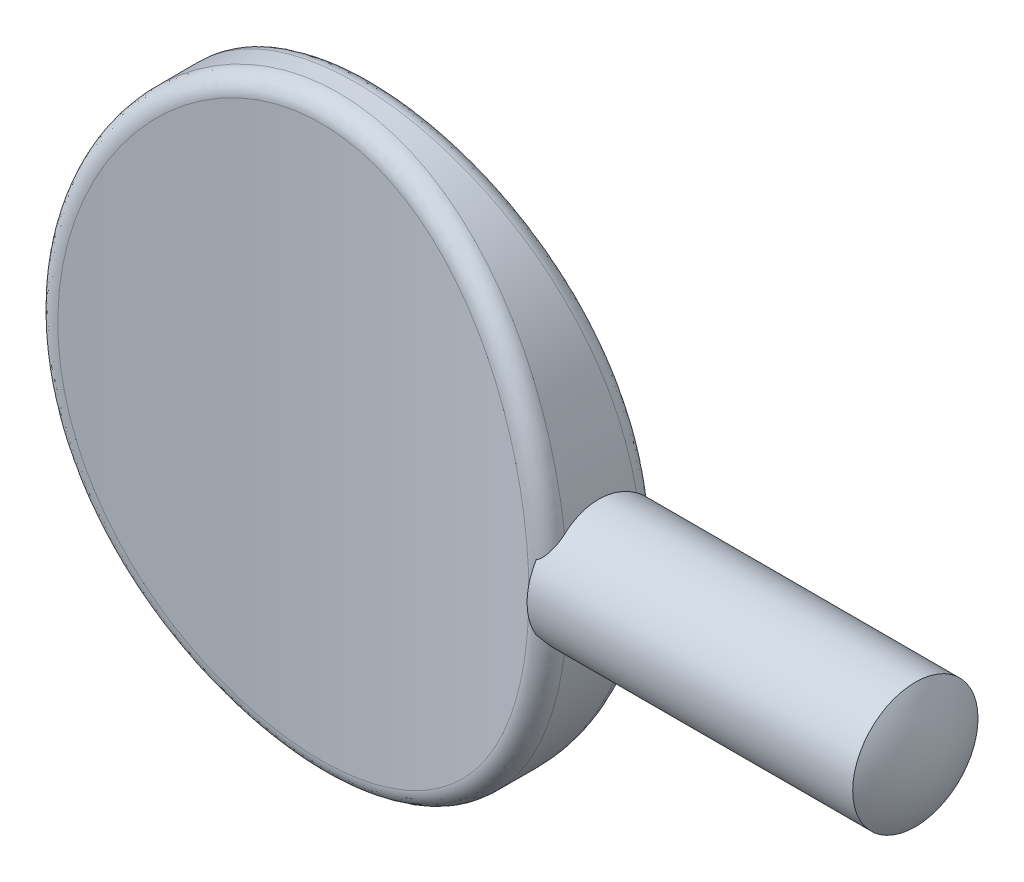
ISO-10303-21;
HEADER;
FILE_DESCRIPTION(('STEP AP214'),'2;1');
FILE_NAME('part.step','',(''),(''),'','','');
FILE_SCHEMA(('AUTOMOTIVE_DESIGN { 1 0 10303 214 1 1 1 1 }'));
ENDSEC;
DATA;
#1=APPLICATION_CONTEXT('core data for automotive mechanical design processes');
#2=APPLICATION_PROTOCOL_DEFINITION('international standard','automotive_design',2000,#1);
#3=PRODUCT_CONTEXT('',#1,'mechanical');
#4=PRODUCT('Part','Part','',(#3));
#5=PRODUCT_RELATED_PRODUCT_CATEGORY('part','',(#4));
#6=PRODUCT_DEFINITION_FORMATION('','',#4);
#7=PRODUCT_DEFINITION_CONTEXT('part definition',#1,'design');
#8=PRODUCT_DEFINITION('design','',#6,#7);
#9=PRODUCT_DEFINITION_SHAPE('','',#8);
#10=(LENGTH_UNIT() NAMED_UNIT(*) SI_UNIT(.MILLI.,.METRE.));
#11=(NAMED_UNIT(*) PLANE_ANGLE_UNIT() SI_UNIT($,.RADIAN.));
#12=(NAMED_UNIT(*) SI_UNIT($,.STERADIAN.) SOLID_ANGLE_UNIT());
#13=UNCERTAINTY_MEASURE_WITH_UNIT(LENGTH_MEASURE(1.E-05),#10,'distance_accuracy_value','');
#14=(GEOMETRIC_REPRESENTATION_CONTEXT(3) GLOBAL_UNCERTAINTY_ASSIGNED_CONTEXT((#13)) GLOBAL_UNIT_ASSIGNED_CONTEXT((#10,
#11,#12)) REPRESENTATION_CONTEXT('',''));
#15=CARTESIAN_POINT('',(0.,0.,0.));
#16=DIRECTION('',(0.,0.,1.));
#17=DIRECTION('',(1.,0.,0.));
#18=AXIS2_PLACEMENT_3D('',#15,#16,#17);
#19=CARTESIAN_POINT('',(0.,0.,2.286));
#20=DIRECTION('',(0.,0.,1.));
#21=DIRECTION('',(0.,-1.,0.));
#22=AXIS2_PLACEMENT_3D('',#19,#20,#21);
#23=ELLIPSE('',#22,11.303,9.906);
#24=DIRECTION('',(0.,0.,-1.));
#25=VECTOR('',#24,1.);
#26=SURFACE_OF_LINEAR_EXTRUSION('',#23,#25);
#27=CARTESIAN_POINT('',(9.75998348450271,-1.93354475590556,1.4435974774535));
#28=CARTESIAN_POINT('',(9.7538599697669,-1.97377990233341,1.3897162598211));
#29=CARTESIAN_POINT('',(9.74788480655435,-2.01176072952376,1.33413671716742));
#30=CARTESIAN_POINT('',(9.73639068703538,-2.08297198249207,1.21996586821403));
#31=CARTESIAN_POINT('',(9.73087174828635,-2.11620222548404,1.16137444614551));
#32=CARTESIAN_POINT('',(9.72044940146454,-2.17767139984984,1.04156116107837));
#33=CARTESIAN_POINT('',(9.71554607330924,-2.20590968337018,0.980338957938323));
#34=CARTESIAN_POINT('',(9.70649644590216,-2.25717945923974,0.855719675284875));
#35=CARTESIAN_POINT('',(9.70235011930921,-2.28021113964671,0.792322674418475));
#36=CARTESIAN_POINT('',(9.69123192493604,-2.34125083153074,0.599394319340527));
#37=CARTESIAN_POINT('',(9.68558076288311,-2.3712039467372,0.467124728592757));
#38=CARTESIAN_POINT('',(9.67850306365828,-2.40853619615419,0.199478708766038));
#39=CARTESIAN_POINT('',(9.67707378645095,-2.4159299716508,0.0641043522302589));
#40=CARTESIAN_POINT('',(9.67858617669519,-2.40802787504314,-0.204493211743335));
#41=CARTESIAN_POINT('',(9.68148053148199,-2.39297760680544,-0.337723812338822));
#42=CARTESIAN_POINT('',(9.6912194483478,-2.34108806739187,-0.599771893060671));
#43=CARTESIAN_POINT('',(9.69806554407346,-2.30424033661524,-0.728587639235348));
#44=CARTESIAN_POINT('',(9.7137074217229,-2.21664920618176,-0.960257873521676));
#45=CARTESIAN_POINT('',(9.72208273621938,-2.16865680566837,-1.06418600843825));
#46=CARTESIAN_POINT('',(9.73584734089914,-2.0861466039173,-1.21400793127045));
#47=CARTESIAN_POINT('',(9.74063407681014,-2.05690073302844,-1.26292205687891));
#48=CARTESIAN_POINT('',(9.7505120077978,-1.99503672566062,-1.35854295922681));
#49=CARTESIAN_POINT('',(9.7556032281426,-1.96241830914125,-1.40524955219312));
#50=CARTESIAN_POINT('',(9.76079800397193,-1.92818422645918,-1.45074966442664));
#51=B_SPLINE_CURVE_WITH_KNOTS('',3,(#27,#28,#29,#30,#31,#32,#33,#34,#35,#36,#37,#38,#39,#40,#41,
#42,#43,#44,#45,#46,#47,#48,#49,#50),.UNSPECIFIED.,.F.,.F.,(4,2,2,2,2,2,2,2,2,2,2,4),(0.,
0.202511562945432,0.405030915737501,0.607576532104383,0.810114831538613,1.2151884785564,
1.61999917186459,2.02041242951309,2.42098118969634,2.7640979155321,2.93554569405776,
3.10700772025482),.UNSPECIFIED.);
#52=CARTESIAN_POINT('',(9.75349384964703,-1.9757193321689,1.38531661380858));
#53=VERTEX_POINT('',#52);
#54=CARTESIAN_POINT('',(9.75349384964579,-1.97571933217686,-1.38531661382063));
#55=VERTEX_POINT('',#54);
#56=EDGE_CURVE('E106',#53,#55,#51,.T.);
#57=ORIENTED_EDGE('',*,*,#56,.F.);
#58=CARTESIAN_POINT('',(9.06433649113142,-0.44155346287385,2.07648141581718));
#59=CARTESIAN_POINT('',(9.89731087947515,-0.473374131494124,2.27409385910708));
#60=CARTESIAN_POINT('',(9.8975763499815,-0.466033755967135,1.41744012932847));
#61=CARTESIAN_POINT('',(9.04072988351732,-1.10521542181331,2.07087783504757));
#62=CARTESIAN_POINT('',(9.87118982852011,-1.18437600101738,2.26734926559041));
#63=CARTESIAN_POINT('',(9.87223120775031,-1.16650607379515,1.41173989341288));
#64=CARTESIAN_POINT('',(8.96387282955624,-1.76690913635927,2.05255322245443));
#65=CARTESIAN_POINT('',(9.78656612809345,-1.89144139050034,2.24540170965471));
#66=CARTESIAN_POINT('',(9.78972693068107,-1.86500634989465,1.39309920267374));
#67=CARTESIAN_POINT('',(8.70423897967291,-3.06740809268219,1.9926113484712));
#68=CARTESIAN_POINT('',(9.49942015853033,-3.28368426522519,2.17332598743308));
#69=CARTESIAN_POINT('',(9.51069658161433,-3.23896299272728,1.33212340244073));
#70=CARTESIAN_POINT('',(8.52144099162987,-3.70620872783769,1.95098942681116));
#71=CARTESIAN_POINT('',(9.29855203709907,-3.96503959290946,2.12360303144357));
#72=CARTESIAN_POINT('',(9.31414769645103,-3.91441472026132,1.28978355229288));
#73=CARTESIAN_POINT('',(8.0522372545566,-4.93844637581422,1.84970425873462));
#74=CARTESIAN_POINT('',(8.78113980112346,-5.28032485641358,2.00228764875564));
#75=CARTESIAN_POINT('',(8.80872239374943,-5.21927582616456,1.18675133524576));
#76=CARTESIAN_POINT('',(7.76638400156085,-5.53210522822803,1.79013749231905));
#77=CARTESIAN_POINT('',(8.46783563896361,-5.91194692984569,1.93136369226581));
#78=CARTESIAN_POINT('',(8.50044492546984,-5.84890960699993,1.12615711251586));
#79=CARTESIAN_POINT('',(7.26256698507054,-6.37458445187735,1.6930635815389));
#80=CARTESIAN_POINT('',(7.91231026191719,-6.81102173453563,1.81528163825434));
#81=CARTESIAN_POINT('',(7.95575827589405,-6.74427599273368,1.02740879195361));
#82=CARTESIAN_POINT('',(7.08198860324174,-6.64756129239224,1.65939540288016));
#83=CARTESIAN_POINT('',(7.71435000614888,-7.10090761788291,1.77525192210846));
#84=CARTESIAN_POINT('',(7.76033985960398,-7.0347130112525,0.993159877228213));
#85=CARTESIAN_POINT('',(6.69635721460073,-7.17472703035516,1.59067374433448));
#86=CARTESIAN_POINT('',(7.29168326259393,-7.6601680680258,1.69362011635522));
#87=CARTESIAN_POINT('',(7.34247562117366,-7.59625745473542,0.923252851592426));
#88=CARTESIAN_POINT('',(6.49131885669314,-7.42892702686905,1.55562110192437));
#89=CARTESIAN_POINT('',(7.06731807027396,-7.9295916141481,1.65205176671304));
#90=CARTESIAN_POINT('',(7.12004597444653,-7.8673762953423,0.887595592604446));
#91=CARTESIAN_POINT('',(6.07339660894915,-7.89779481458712,1.48797563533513));
#92=CARTESIAN_POINT('',(6.61001404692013,-8.4261411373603,1.57189456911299));
#93=CARTESIAN_POINT('',(6.66603588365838,-8.36809358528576,0.81878332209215));
#94=CARTESIAN_POINT('',(5.8621693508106,-8.11399325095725,1.45538942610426));
#95=CARTESIAN_POINT('',(6.37923621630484,-8.65490610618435,1.53333835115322));
#96=CARTESIAN_POINT('',(6.43629914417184,-8.59927776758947,0.785635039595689));
#97=CARTESIAN_POINT('',(5.420462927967,-8.52495389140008,1.39126982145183));
#98=CARTESIAN_POINT('',(5.89686229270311,-9.0892487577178,1.45756148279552));
#99=CARTESIAN_POINT('',(5.95522830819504,-9.03927334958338,0.720409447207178));
#100=CARTESIAN_POINT('',(5.1899952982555,-8.71972877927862,1.3597358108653));
#101=CARTESIAN_POINT('',(5.64541451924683,-9.29504742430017,1.42032518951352));
#102=CARTESIAN_POINT('',(5.7039071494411,-9.24809798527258,0.68833151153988));
#103=CARTESIAN_POINT('',(4.7112180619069,-9.08513182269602,1.29889201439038));
#104=CARTESIAN_POINT('',(5.12333296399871,-9.68063953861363,1.3485736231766));
#105=CARTESIAN_POINT('',(5.18108360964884,-9.64035101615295,0.626438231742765));
#106=CARTESIAN_POINT('',(4.46292238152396,-9.25577852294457,1.26958052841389));
#107=CARTESIAN_POINT('',(4.85275176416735,-9.86072624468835,1.3140212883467));
#108=CARTESIAN_POINT('',(4.90959697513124,-9.8237989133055,0.596621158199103));
#109=CARTESIAN_POINT('',(3.95012425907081,-9.57035676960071,1.21433232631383));
#110=CARTESIAN_POINT('',(4.29427737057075,-10.1922417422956,1.24898931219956));
#111=CARTESIAN_POINT('',(4.34815021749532,-10.1623803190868,0.540419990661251));
#112=CARTESIAN_POINT('',(3.68562512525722,-9.71429374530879,1.18839492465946));
#113=CARTESIAN_POINT('',(4.00630404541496,-10.343992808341,1.21845738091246));
#114=CARTESIAN_POINT('',(4.05819386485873,-10.3175195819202,0.514035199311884));
#115=CARTESIAN_POINT('',(3.18095813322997,-9.95464296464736,1.14434912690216));
#116=CARTESIAN_POINT('',(3.45702558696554,-10.5971097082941,1.16666988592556));
#117=CARTESIAN_POINT('',(3.50428103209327,-10.5768490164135,0.469229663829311));
#118=CARTESIAN_POINT('',(2.94260311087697,-10.0548925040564,1.12565265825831));
#119=CARTESIAN_POINT('',(3.19771589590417,-10.7026948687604,1.14469031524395));
#120=CARTESIAN_POINT('',(3.24240658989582,-10.6851365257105,0.450210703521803));
#121=CARTESIAN_POINT('',(2.45745188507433,-10.2322329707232,1.09221652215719));
#122=CARTESIAN_POINT('',(2.67025548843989,-10.8892399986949,1.10543443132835));
#123=CARTESIAN_POINT('',(2.70890894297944,-10.8768424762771,0.416197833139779));
#124=CARTESIAN_POINT('',(2.21065722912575,-10.3093281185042,1.0774761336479));
#125=CARTESIAN_POINT('',(2.40189348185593,-10.9703962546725,1.08811890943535));
#126=CARTESIAN_POINT('',(2.43728752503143,-10.9602654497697,0.401203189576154));
#127=CARTESIAN_POINT('',(1.71091716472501,-10.4390517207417,1.05249286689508));
#128=CARTESIAN_POINT('',(1.85884865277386,-11.1067770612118,1.0588103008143));
#129=CARTESIAN_POINT('',(1.88689681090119,-11.1007143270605,0.375788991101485));
#130=CARTESIAN_POINT('',(1.45797707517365,-10.4917005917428,1.04224623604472));
#131=CARTESIAN_POINT('',(1.58389234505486,-11.1621799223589,1.04677989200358));
#132=CARTESIAN_POINT('',(1.60813368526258,-11.1577622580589,0.365365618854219));
#133=CARTESIAN_POINT('',(0.948114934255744,-10.5716983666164,1.02661952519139));
#134=CARTESIAN_POINT('',(1.03003449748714,-11.2462512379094,1.02845752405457));
#135=CARTESIAN_POINT('',(1.04597206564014,-11.2444700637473,0.349469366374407));
#136=CARTESIAN_POINT('',(0.691193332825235,-10.5990501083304,1.02123889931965));
#137=CARTESIAN_POINT('',(0.75080259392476,-11.2750269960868,1.02214236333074));
#138=CARTESIAN_POINT('',(0.762574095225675,-11.2741330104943,0.343995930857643));
#139=CARTESIAN_POINT('',(0.209209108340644,-10.6261003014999,1.01591573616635));
#140=CARTESIAN_POINT('',(0.227293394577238,-11.3034522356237,1.01590196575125));
#141=CARTESIAN_POINT('',(0.23083451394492,-11.3034697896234,0.338580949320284));
#142=CARTESIAN_POINT('',(-0.0156831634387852,-10.6289136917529,1.01536066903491));
#143=CARTESIAN_POINT('',(-0.0170749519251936,-11.3064105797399,1.01525084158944));
#144=CARTESIAN_POINT('',(-0.0173081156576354,-11.3065216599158,0.338016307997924));
#145=CARTESIAN_POINT('',(-0.464932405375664,-10.6149527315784,1.01810993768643));
#146=CARTESIAN_POINT('',(-0.504998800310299,-11.2917412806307,1.01847351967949));
#147=CARTESIAN_POINT('',(-0.512964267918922,-11.291379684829,0.340812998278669));
#148=CARTESIAN_POINT('',(-0.689289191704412,-10.5981724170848,1.02141544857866));
#149=CARTESIAN_POINT('',(-0.748793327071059,-11.2740929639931,1.02235186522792));
#150=CARTESIAN_POINT('',(-0.760477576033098,-11.2731793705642,0.344175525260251));
#151=CARTESIAN_POINT('',(-1.13556884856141,-10.5452601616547,1.0317883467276));
#152=CARTESIAN_POINT('',(-1.23354170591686,-11.2184912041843,1.03451259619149));
#153=CARTESIAN_POINT('',(-1.25267682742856,-11.2158123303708,0.354727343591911));
#154=CARTESIAN_POINT('',(-1.35749296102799,-10.5091386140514,1.03885371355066));
#155=CARTESIAN_POINT('',(-1.47472448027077,-11.1804953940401,1.04280421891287));
#156=CARTESIAN_POINT('',(-1.49736421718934,-11.1766568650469,0.361914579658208));
#157=CARTESIAN_POINT('',(-1.79749977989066,-10.4180266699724,1.05654330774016));
#158=CARTESIAN_POINT('',(-1.95276892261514,-11.0847276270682,1.06355029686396));
#159=CARTESIAN_POINT('',(-1.98226996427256,-11.0779503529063,0.379909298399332));
#160=CARTESIAN_POINT('',(-2.01558099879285,-10.3630291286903,1.06716888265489));
#161=CARTESIAN_POINT('',(-2.18983193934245,-11.026861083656,1.07602492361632));
#162=CARTESIAN_POINT('',(-2.22248659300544,-11.0183915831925,0.390718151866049));
#163=CARTESIAN_POINT('',(-2.44049679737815,-10.2366111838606,1.09134888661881));
#164=CARTESIAN_POINT('',(-2.65162302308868,-10.8939375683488,1.1043971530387));
#165=CARTESIAN_POINT('',(-2.69022849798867,-10.8815920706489,0.415315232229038));
#166=CARTESIAN_POINT('',(-2.64747600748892,-10.1656759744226,1.10481618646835));
#167=CARTESIAN_POINT('',(-2.8766883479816,-10.8192776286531,1.120215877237));
#168=CARTESIAN_POINT('',(-2.91792129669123,-10.8048739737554,0.429014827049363));
#169=CARTESIAN_POINT('',(-3.05512217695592,-10.0074393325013,1.13449174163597));
#170=CARTESIAN_POINT('',(-3.31994587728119,-10.6528031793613,1.15506402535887));
#171=CARTESIAN_POINT('',(-3.3660255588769,-10.6338821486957,0.459202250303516));
#172=CARTESIAN_POINT('',(-3.25578691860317,-9.92013222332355,1.15070094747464));
#173=CARTESIAN_POINT('',(-3.53825524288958,-10.5608636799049,1.17411805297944));
#174=CARTESIAN_POINT('',(-3.58643446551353,-10.5396023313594,0.47569104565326));
#175=CARTESIAN_POINT('',(-3.84654426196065,-9.63504101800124,1.20285461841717));
#176=CARTESIAN_POINT('',(-4.18237180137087,-10.2600882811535,1.23554873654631));
#177=CARTESIAN_POINT('',(-4.23476308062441,-10.2320328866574,0.528744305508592));
#178=CARTESIAN_POINT('',(-4.22571339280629,-9.41399224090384,1.24234388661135));
#179=CARTESIAN_POINT('',(-4.59539551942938,-10.0267310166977,1.28209163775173));
#180=CARTESIAN_POINT('',(-4.6501297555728,-9.99391046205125,0.568914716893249));
#181=CARTESIAN_POINT('',(-4.97579964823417,-8.8988503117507,1.3305459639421));
#182=CARTESIAN_POINT('',(-5.41315254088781,-9.48328684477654,1.38604753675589));
#183=CARTESIAN_POINT('',(-5.47030400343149,-9.44018886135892,0.658638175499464));
#184=CARTESIAN_POINT('',(-5.34372659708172,-8.60038202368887,1.37973973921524));
#185=CARTESIAN_POINT('',(-5.8143879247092,-9.16774150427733,1.44414433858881));
#186=CARTESIAN_POINT('',(-5.8717165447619,-9.11997166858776,0.70868048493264));
#187=CARTESIAN_POINT('',(-6.03184666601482,-7.95150761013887,1.4804681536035));
#188=CARTESIAN_POINT('',(-6.56597991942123,-8.48184990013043,1.56320931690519));
#189=CARTESIAN_POINT('',(-6.62102535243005,-8.42537982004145,0.811146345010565));
#190=CARTESIAN_POINT('',(-6.35201943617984,-7.60107946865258,1.53200377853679));
#191=CARTESIAN_POINT('',(-6.91576322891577,-8.11070576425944,1.62422932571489));
#192=CARTESIAN_POINT('',(-6.96889880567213,-8.05098220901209,0.863570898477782));
#193=CARTESIAN_POINT('',(-6.97998081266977,-6.80920807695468,1.63984325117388));
#194=CARTESIAN_POINT('',(-7.60405609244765,-7.27066586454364,1.75228632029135));
#195=CARTESIAN_POINT('',(-7.65003938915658,-7.20661845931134,0.973270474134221));
#196=CARTESIAN_POINT('',(-7.28060968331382,-6.36185596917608,1.69588343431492));
#197=CARTESIAN_POINT('',(-7.93313272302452,-6.79574608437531,1.81884441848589));
#198=CARTESIAN_POINT('',(-7.97537608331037,-6.73055907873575,1.03027728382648));
#199=CARTESIAN_POINT('',(-7.81370754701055,-5.42598150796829,1.8002849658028));
#200=CARTESIAN_POINT('',(-8.51893240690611,-5.80032940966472,1.94329479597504));
#201=CARTESIAN_POINT('',(-8.55143234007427,-5.73641613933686,1.13647961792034));
#202=CARTESIAN_POINT('',(-8.04612685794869,-4.93742947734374,1.84864070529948));
#203=CARTESIAN_POINT('',(-8.77401400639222,-5.28031393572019,2.00093018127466));
#204=CARTESIAN_POINT('',(-8.80209751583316,-5.21830229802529,1.18566943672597));
#205=CARTESIAN_POINT('',(-8.46579777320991,-3.86798278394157,1.93874221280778));
#206=CARTESIAN_POINT('',(-9.2369525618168,-4.13843974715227,2.10886875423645));
#207=CARTESIAN_POINT('',(-9.25424841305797,-4.08562792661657,1.27732508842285));
#208=CARTESIAN_POINT('',(-8.6437754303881,-3.28317788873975,1.97890682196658));
#209=CARTESIAN_POINT('',(-9.43263150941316,-3.51458104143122,2.15687234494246));
#210=CARTESIAN_POINT('',(-9.44567392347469,-3.46710594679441,1.31818248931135));
#211=CARTESIAN_POINT('',(-8.90988228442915,-2.09221318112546,2.03992221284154));
#212=CARTESIAN_POINT('',(-9.72684753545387,-2.24001917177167,2.23020914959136));
#213=CARTESIAN_POINT('',(-9.73173019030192,-2.20856660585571,1.38025032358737));
#214=CARTESIAN_POINT('',(-8.99807319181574,-1.48606833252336,2.06078625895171));
#215=CARTESIAN_POINT('',(-9.82401541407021,-1.59219662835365,2.25521159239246));
#216=CARTESIAN_POINT('',(-9.82642742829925,-1.56856432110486,1.40147425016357));
#217=CARTESIAN_POINT('',(-9.07155097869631,-0.448175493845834,2.07818799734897));
#218=CARTESIAN_POINT('',(-9.90531304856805,-0.480096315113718,2.27615280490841));
#219=CARTESIAN_POINT('',(-9.90532310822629,-0.472998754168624,1.41917614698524));
#220=CARTESIAN_POINT('',(-9.07960069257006,-0.018024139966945,2.08010539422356));
#221=CARTESIAN_POINT('',(-9.91421749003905,-0.019501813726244,2.27845976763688));
#222=CARTESIAN_POINT('',(-9.91396460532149,-0.0190320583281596,1.42112661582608));
#223=CARTESIAN_POINT('',(-9.05114135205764,0.840874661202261,2.0733483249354));
#224=CARTESIAN_POINT('',(-9.88270871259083,0.901272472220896,2.27032260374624));
#225=CARTESIAN_POINT('',(-9.88340958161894,0.887501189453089,1.41425299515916));
#226=CARTESIAN_POINT('',(-9.01462354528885,1.26962181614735,2.06467177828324));
#227=CARTESIAN_POINT('',(-9.84236732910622,1.3602608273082,2.25989703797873));
#228=CARTESIAN_POINT('',(-9.84420366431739,1.34006744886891,1.40542678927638));
#229=CARTESIAN_POINT('',(-8.90937536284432,2.0316986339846,2.0400225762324));
#230=CARTESIAN_POINT('',(-9.72583784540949,2.17696234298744,2.23022004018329));
#231=CARTESIAN_POINT('',(-9.73114985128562,2.14477756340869,1.3803524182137));
#232=CARTESIAN_POINT('',(-8.8489354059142,2.36630778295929,2.02594526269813));
#233=CARTESIAN_POINT('',(-9.65907544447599,2.53501090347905,2.2133119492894));
#234=CARTESIAN_POINT('',(-9.66621476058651,2.49821035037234,1.3660322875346));
#235=CARTESIAN_POINT('',(-8.70028670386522,3.02889346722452,1.99186677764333));
#236=CARTESIAN_POINT('',(-9.49474440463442,3.24406808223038,2.17235903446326));
#237=CARTESIAN_POINT('',(-9.50642120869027,3.19839647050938,1.33136598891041));
#238=CARTESIAN_POINT('',(-8.61207087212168,3.35686828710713,1.97186409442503));
#239=CARTESIAN_POINT('',(-9.39741618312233,3.59458478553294,2.14837201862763));
#240=CARTESIAN_POINT('',(-9.41155511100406,3.54514807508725,1.31101828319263));
#241=CARTESIAN_POINT('',(-8.40792982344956,4.00383954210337,1.92654702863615));
#242=CARTESIAN_POINT('',(-9.17207272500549,4.28589025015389,2.09402079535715));
#243=CARTESIAN_POINT('',(-9.19186339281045,4.22959703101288,1.26491955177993));
#244=CARTESIAN_POINT('',(-8.29197010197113,4.32282423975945,1.90122603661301));
#245=CARTESIAN_POINT('',(-9.04433751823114,4.62626387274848,2.06371975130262));
#246=CARTESIAN_POINT('',(-9.06700046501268,4.56728252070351,1.2391618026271));
#247=CARTESIAN_POINT('',(-8.03266921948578,4.94864016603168,1.84612445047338));
#248=CARTESIAN_POINT('',(-8.75862164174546,5.29375063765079,1.99779283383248));
#249=CARTESIAN_POINT('',(-8.78753573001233,5.23032676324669,1.18310977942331));
#250=CARTESIAN_POINT('',(-7.88933080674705,5.25547261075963,1.8163443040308));
#251=CARTESIAN_POINT('',(-8.60101160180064,5.62056800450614,1.96224124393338));
#252=CARTESIAN_POINT('',(-8.63293690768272,5.55568674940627,1.15281596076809));
#253=CARTESIAN_POINT('',(-7.5827057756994,5.84065532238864,1.75476032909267));
#254=CARTESIAN_POINT('',(-8.26377031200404,6.24355498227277,1.88874534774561));
#255=CARTESIAN_POINT('',(-8.301864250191,6.17681298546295,1.09016973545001));
#256=CARTESIAN_POINT('',(-7.42060725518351,6.11966595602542,1.72310789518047));
#257=CARTESIAN_POINT('',(-8.08585157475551,6.54018510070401,1.85105198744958));
#258=CARTESIAN_POINT('',(-8.12668803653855,6.47325210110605,1.05797133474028));
#259=CARTESIAN_POINT('',(-7.07231803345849,6.66122664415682,1.65771330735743));
#260=CARTESIAN_POINT('',(-7.70361694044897,7.11546435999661,1.77323427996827));
#261=CARTESIAN_POINT('',(-7.74985395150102,7.04926217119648,0.99144876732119));
#262=CARTESIAN_POINT('',(-6.88614017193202,6.92378536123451,1.62397227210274));
#263=CARTESIAN_POINT('',(-7.49964582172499,7.3940837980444,1.73315517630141));
#264=CARTESIAN_POINT('',(-7.54821019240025,7.32884199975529,0.957125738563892));
#265=CARTESIAN_POINT('',(-6.4902981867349,7.42975304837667,1.55555294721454));
#266=CARTESIAN_POINT('',(-7.06608461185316,7.93046508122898,1.6519609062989));
#267=CARTESIAN_POINT('',(-7.11892134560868,7.8682572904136,0.88752626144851));
#268=CARTESIAN_POINT('',(-6.2806366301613,7.67316410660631,1.52087476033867));
#269=CARTESIAN_POINT('',(-6.83678956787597,8.18830586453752,1.61086921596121));
#270=CARTESIAN_POINT('',(-6.89127909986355,8.12809490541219,0.852249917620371));
#271=CARTESIAN_POINT('',(-5.8388607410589,8.13772708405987,1.45187677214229));
#272=CARTESIAN_POINT('',(-6.35382230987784,8.67984460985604,1.52920305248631));
#273=CARTESIAN_POINT('',(-6.41093575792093,8.62464950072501,0.782061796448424));
#274=CARTESIAN_POINT('',(-5.60676139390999,8.35889366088,1.417556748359));
#275=CARTESIAN_POINT('',(-6.10038934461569,8.91374416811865,1.48862685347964));
#276=CARTESIAN_POINT('',(-6.15825138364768,8.86138170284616,0.747149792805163));
#277=CARTESIAN_POINT('',(-5.14547789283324,8.75521824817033,1.35394959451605));
#278=CARTESIAN_POINT('',(-5.59675257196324,9.33250836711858,1.41349407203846));
#279=CARTESIAN_POINT('',(-5.65531654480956,9.28616485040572,0.682445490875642));
#280=CARTESIAN_POINT('',(-4.91829844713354,8.9327643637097,1.32450134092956));
#281=CARTESIAN_POINT('',(-5.34900946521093,9.52000076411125,1.37874615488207));
#282=CARTESIAN_POINT('',(-5.40732214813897,9.47671576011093,0.652489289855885));
#283=CARTESIAN_POINT('',(-4.44814344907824,9.26490654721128,1.26802841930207));
#284=CARTESIAN_POINT('',(-4.83658148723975,9.87031362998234,1.31219664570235));
#285=CARTESIAN_POINT('',(-4.89341430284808,9.83361103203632,0.595042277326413));
#286=CARTESIAN_POINT('',(-4.20517788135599,9.41951692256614,1.24100224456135));
#287=CARTESIAN_POINT('',(-4.57190339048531,10.0334050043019,1.28035681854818));
#288=CARTESIAN_POINT('',(-4.62751217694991,9.99997048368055,0.567549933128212));
#289=CARTESIAN_POINT('',(-3.7052575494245,9.7034163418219,1.1903933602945));
#290=CARTESIAN_POINT('',(-4.02765051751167,10.3324758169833,1.22081747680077));
#291=CARTESIAN_POINT('',(-4.07971355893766,10.3057842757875,0.516068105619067));
#292=CARTESIAN_POINT('',(-3.44831525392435,9.83272749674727,1.16680764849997));
#293=CARTESIAN_POINT('',(-3.74797965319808,10.4687607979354,1.19306613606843));
#294=CARTESIAN_POINT('',(-3.79783131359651,10.4452621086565,0.492075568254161));
#295=CARTESIAN_POINT('',(-2.92242796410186,10.0639380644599,1.12400959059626));
#296=CARTESIAN_POINT('',(-3.17597688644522,10.7120881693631,1.14278503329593));
#297=CARTESIAN_POINT('',(-3.22025584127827,10.6948915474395,0.448539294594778));
#298=CARTESIAN_POINT('',(-2.65348535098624,10.1658428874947,1.10479638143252));
#299=CARTESIAN_POINT('',(-2.88342317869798,10.8194170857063,1.12020062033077));
#300=CARTESIAN_POINT('',(-2.92456535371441,10.8050489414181,0.428994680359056));
#301=CARTESIAN_POINT('',(-2.14710069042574,10.3272733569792,1.07404899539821));
#302=CARTESIAN_POINT('',(-2.3328441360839,10.9892348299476,1.08410380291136));
#303=CARTESIAN_POINT('',(-2.36731608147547,10.9796823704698,0.39771693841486));
#304=CARTESIAN_POINT('',(-1.91094499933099,10.3908533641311,1.06179682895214));
#305=CARTESIAN_POINT('',(-2.07610071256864,11.0561454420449,1.06971620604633));
#306=CARTESIAN_POINT('',(-2.10724644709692,11.0485217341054,0.385253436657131));
#307=CARTESIAN_POINT('',(-1.43374613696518,10.4958098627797,1.04145662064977));
#308=CARTESIAN_POINT('',(-1.55762642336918,11.1664699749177,1.04586002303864));
#309=CARTESIAN_POINT('',(-1.5814284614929,11.1622105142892,0.364562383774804));
#310=CARTESIAN_POINT('',(-1.19270367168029,10.5371895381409,1.03336798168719));
#311=CARTESIAN_POINT('',(-1.29564078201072,11.2100047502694,1.03636574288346));
#312=CARTESIAN_POINT('',(-1.3156809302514,11.2070633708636,0.35633422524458));
#313=CARTESIAN_POINT('',(-0.707915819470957,10.5970726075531,1.02163323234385));
#314=CARTESIAN_POINT('',(-0.769059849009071,11.2729324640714,1.02260821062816));
#315=CARTESIAN_POINT('',(-0.781028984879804,11.2719859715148,0.3443970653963));
#316=CARTESIAN_POINT('',(-0.464172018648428,10.6155887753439,1.01798464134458));
#317=CARTESIAN_POINT('',(-0.504175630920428,11.2924099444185,1.01832657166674));
#318=CARTESIAN_POINT('',(-0.512126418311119,11.2920695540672,0.340685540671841));
#319=CARTESIAN_POINT('',(0.0239742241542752,10.6294808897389,1.01524901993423));
#320=CARTESIAN_POINT('',(0.0259922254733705,11.3070062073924,1.01512004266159));
#321=CARTESIAN_POINT('',(0.026447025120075,11.3071368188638,0.337902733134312));
#322=CARTESIAN_POINT('',(0.268376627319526,10.6248581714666,1.01616172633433));
#323=CARTESIAN_POINT('',(0.291583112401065,11.3021433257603,1.01619112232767));
#324=CARTESIAN_POINT('',(0.296117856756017,11.3021219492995,0.338831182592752));
#325=CARTESIAN_POINT('',(0.731015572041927,10.5941897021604,1.02219342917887));
#326=CARTESIAN_POINT('',(0.794042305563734,11.2699210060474,1.02326107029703));
#327=CARTESIAN_POINT('',(0.806497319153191,11.2688626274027,0.344966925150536));
#328=CARTESIAN_POINT('',(0.949402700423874,10.5703538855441,1.02687846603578));
#329=CARTESIAN_POINT('',(1.03135419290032,11.2448516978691,1.02875824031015));
#330=CARTESIAN_POINT('',(1.04738130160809,11.2430144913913,0.34973277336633));
#331=CARTESIAN_POINT('',(1.38344630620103,10.5043595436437,1.03977653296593));
#332=CARTESIAN_POINT('',(1.5028466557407,11.175496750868,1.04388124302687));
#333=CARTESIAN_POINT('',(1.52596681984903,11.1714816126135,0.362853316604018));
#334=CARTESIAN_POINT('',(1.59910191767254,10.4621953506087,1.04799065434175));
#335=CARTESIAN_POINT('',(1.73723082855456,11.1311427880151,1.05352185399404));
#336=CARTESIAN_POINT('',(1.76366734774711,11.1257907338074,0.371209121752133));
#337=CARTESIAN_POINT('',(2.02606245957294,10.3600924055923,1.06772057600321));
#338=CARTESIAN_POINT('',(2.20115032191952,11.0238097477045,1.07666464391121));
#339=CARTESIAN_POINT('',(2.23402228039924,11.0152178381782,0.391279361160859));
#340=CARTESIAN_POINT('',(2.23736912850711,10.3001609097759,1.07923502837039));
#341=CARTESIAN_POINT('',(2.43086687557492,10.9607473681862,1.09018446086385));
#342=CARTESIAN_POINT('',(2.46667870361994,10.9503436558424,0.402992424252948));
#343=CARTESIAN_POINT('',(2.65441619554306,10.1632551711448,1.10525920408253));
#344=CARTESIAN_POINT('',(2.88420079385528,10.8167652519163,1.12072955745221));
#345=CARTESIAN_POINT('',(2.92555248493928,10.8022616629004,0.429465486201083));
#346=CARTESIAN_POINT('',(2.86015443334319,10.0862744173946,1.11977007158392));
#347=CARTESIAN_POINT('',(3.10796098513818,10.7357272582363,1.13777888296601));
#348=CARTESIAN_POINT('',(3.15176734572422,10.7190468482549,0.444226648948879));
#349=CARTESIAN_POINT('',(3.47229190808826,9.82882926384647,1.16766697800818));
#350=CARTESIAN_POINT('',(3.77502068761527,10.4642750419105,1.1941529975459));
#351=CARTESIAN_POINT('',(3.82428787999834,10.4410018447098,0.49294972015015));
#352=CARTESIAN_POINT('',(3.8683972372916,9.62312725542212,1.20516354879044));
#353=CARTESIAN_POINT('',(4.2063791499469,10.2471702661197,1.23832898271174));
#354=CARTESIAN_POINT('',(4.25872054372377,10.2191448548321,0.531093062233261));
#355=CARTESIAN_POINT('',(4.62459293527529,9.15366768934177,1.28740400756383));
#356=CARTESIAN_POINT('',(5.03001761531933,9.75240293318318,1.33514205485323));
#357=CARTESIAN_POINT('',(5.08654839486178,9.71393277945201,0.614752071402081));
#358=CARTESIAN_POINT('',(4.9846713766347,8.88989099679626,1.33215028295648));
#359=CARTESIAN_POINT('',(5.42252640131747,9.47370233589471,1.38794594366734));
#360=CARTESIAN_POINT('',(5.47992999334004,9.4305574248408,0.660270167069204));
#361=CARTESIAN_POINT('',(5.69889695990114,8.28317315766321,1.42989181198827));
#362=CARTESIAN_POINT('',(6.20241802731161,8.83257556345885,1.50340477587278));
#363=CARTESIAN_POINT('',(6.25876561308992,8.78017530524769,0.759697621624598));
#364=CARTESIAN_POINT('',(6.04858866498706,7.93486893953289,1.48326169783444));
#365=CARTESIAN_POINT('',(6.58418732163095,8.46389482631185,1.56654004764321));
#366=CARTESIAN_POINT('',(6.63920256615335,8.40755316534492,0.813988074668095));
#367=CARTESIAN_POINT('',(6.69355774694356,7.18955442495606,1.58930188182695));
#368=CARTESIAN_POINT('',(7.2899603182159,7.67454843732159,1.69221318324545));
#369=CARTESIAN_POINT('',(7.33958984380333,7.61192292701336,0.921857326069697));
#370=CARTESIAN_POINT('',(6.98880792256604,6.79251994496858,1.64197181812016));
#371=CARTESIAN_POINT('',(7.6129815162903,7.25337948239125,1.75470923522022));
#372=CARTESIAN_POINT('',(7.6595099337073,7.1888898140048,0.975435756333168));
#373=CARTESIAN_POINT('',(7.55852416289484,5.9035257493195,1.74907555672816));
#374=CARTESIAN_POINT('',(8.23879298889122,6.30821299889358,1.88227557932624));
#375=CARTESIAN_POINT('',(8.27589606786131,6.24338332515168,1.08438690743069));
#376=CARTESIAN_POINT('',(7.82473612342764,5.40599546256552,1.80277922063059));
#377=CARTESIAN_POINT('',(8.53065041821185,5.77912309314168,1.94620221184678));
#378=CARTESIAN_POINT('',(8.56329170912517,5.71520536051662,1.13901689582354));
#379=CARTESIAN_POINT('',(8.2814684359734,4.37513696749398,1.89847802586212));
#380=CARTESIAN_POINT('',(9.03367283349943,4.68015804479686,2.06063032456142));
#381=CARTESIAN_POINT('',(9.05576917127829,4.6225145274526,1.23636639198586));
#382=CARTESIAN_POINT('',(8.47195257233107,3.84179177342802,1.94046756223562));
#383=CARTESIAN_POINT('',(9.24305355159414,4.11150478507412,2.11078670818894));
#384=CARTESIAN_POINT('',(9.26081160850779,4.05798442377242,1.27908019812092));
#385=CARTESIAN_POINT('',(8.79277988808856,2.69157447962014,2.01267902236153));
#386=CARTESIAN_POINT('',(9.5976206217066,2.88109997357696,2.1975157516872));
#387=CARTESIAN_POINT('',(9.60591371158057,2.8417227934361,1.35253722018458));
#388=CARTESIAN_POINT('',(8.91415781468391,2.07198286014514,2.04108919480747));
#389=CARTESIAN_POINT('',(9.73122319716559,2.21931200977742,2.23152481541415));
#390=CARTESIAN_POINT('',(9.73629583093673,2.18724629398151,1.38143743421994));
#391=CARTESIAN_POINT('',(9.06115860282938,0.820487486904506,2.07565423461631));
#392=CARTESIAN_POINT('',(9.89394740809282,0.878268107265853,2.27313745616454));
#393=CARTESIAN_POINT('',(9.89417614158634,0.865911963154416,1.41659868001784));
#394=CARTESIAN_POINT('',(9.0867504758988,0.18857981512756,2.08180189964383));
#395=CARTESIAN_POINT('',(9.92214545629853,0.202610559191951,2.2805062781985));
#396=CARTESIAN_POINT('',(9.92164103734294,0.199050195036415,1.4228523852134));
#397=CARTESIAN_POINT('',(9.06433649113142,-0.44155346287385,2.07648141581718));
#398=CARTESIAN_POINT('',(9.89731087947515,-0.473374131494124,2.27409385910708));
#399=CARTESIAN_POINT('',(9.8975763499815,-0.466033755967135,1.41744012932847));
#400=(BOUNDED_SURFACE() B_SPLINE_SURFACE(3,2,((#58,#59,#60),(#61,#62,#63),(#64,#65,#66),(#67,
#68,#69),(#70,#71,#72),(#73,#74,#75),(#76,#77,#78),(#79,#80,#81),(#82,#83,#84),(#85,#86,#87),
(#88,#89,#90),(#91,#92,#93),(#94,#95,#96),(#97,#98,#99),(#100,#101,#102),(#103,#104,#105),(#106,
#107,#108),(#109,#110,#111),(#112,#113,#114),(#115,#116,#117),(#118,#119,#120),(#121,#122,#123),
(#124,#125,#126),(#127,#128,#129),(#130,#131,#132),(#133,#134,#135),(#136,#137,#138),(#139,#140,
#141),(#142,#143,#144),(#145,#146,#147),(#148,#149,#150),(#151,#152,#153),(#154,#155,#156),
(#157,#158,#159),(#160,#161,#162),(#163,#164,#165),(#166,#167,#168),(#169,#170,#171),(#172,#173,
#174),(#175,#176,#177),(#178,#179,#180),(#181,#182,#183),(#184,#185,#186),(#187,#188,#189),
(#190,#191,#192),(#193,#194,#195),(#196,#197,#198),(#199,#200,#201),(#202,#203,#204),(#205,#206,
#207),(#208,#209,#210),(#211,#212,#213),(#214,#215,#216),(#217,#218,#219),(#220,#221,#222),
(#223,#224,#225),(#226,#227,#228),(#229,#230,#231),(#232,#233,#234),(#235,#236,#237),(#238,#239,
#240),(#241,#242,#243),(#244,#245,#246),(#247,#248,#249),(#250,#251,#252),(#253,#254,#255),
(#256,#257,#258),(#259,#260,#261),(#262,#263,#264),(#265,#266,#267),(#268,#269,#270),(#271,#272,
#273),(#274,#275,#276),(#277,#278,#279),(#280,#281,#282),(#283,#284,#285),(#286,#287,#288),
(#289,#290,#291),(#292,#293,#294),(#295,#296,#297),(#298,#299,#300),(#301,#302,#303),(#304,#305,
#306),(#307,#308,#309),(#310,#311,#312),(#313,#314,#315),(#316,#317,#318),(#319,#320,#321),
(#322,#323,#324),(#325,#326,#327),(#328,#329,#330),(#331,#332,#333),(#334,#335,#336),(#337,#338,
#339),(#340,#341,#342),(#343,#344,#345),(#346,#347,#348),(#349,#350,#351),(#352,#353,#354),
(#355,#356,#357),(#358,#359,#360),(#361,#362,#363),(#364,#365,#366),(#367,#368,#369),(#370,#371,
#372),(#373,#374,#375),(#376,#377,#378),(#379,#380,#381),(#382,#383,#384),(#385,#386,#387),
(#388,#389,#390),(#391,#392,#393),(#394,#395,#396),(#397,#398,#399)),.UNSPECIFIED.,.T.,.F.,
.F.) B_SPLINE_SURFACE_WITH_KNOTS((4,2,2,2,2,2,2,2,2,2,2,2,2,2,2,2,2,2,2,2,2,2,2,2,2,2,2,2,2,2,2,
2,2,2,2,2,2,2,2,2,2,2,2,2,2,2,2,2,2,2,2,2,2,2,2,2,4),(3,3),(0.,1.99013383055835,
3.98066589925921,5.9606813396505,6.95189992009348,7.942527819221,8.86106937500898,
9.77906414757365,10.6963494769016,11.6134481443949,12.4015093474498,13.1894268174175,
13.9766850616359,14.7638549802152,15.4493720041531,16.135097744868,16.8204553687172,
17.5060726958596,18.1731188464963,18.8403967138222,20.1739641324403,21.6123317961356,
23.0513106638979,24.6794364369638,26.3087451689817,28.1416611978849,29.9733166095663,
31.2617105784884,32.5503576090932,33.5706861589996,34.5912752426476,35.6131402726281,
36.6349027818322,37.6106807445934,38.5859405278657,39.5610938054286,40.5356002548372,
41.4132125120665,42.2902749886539,43.1665674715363,44.0426868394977,44.7880998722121,
45.5334059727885,46.2782954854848,47.0231420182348,47.6927906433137,48.3626464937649,
49.0322291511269,49.7020679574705,51.0579388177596,52.4142570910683,53.9106893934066,
55.4078673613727,57.1081651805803,58.8092751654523,60.6982549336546,62.5878457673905),(0.,1.),
.UNSPECIFIED.) GEOMETRIC_REPRESENTATION_ITEM() RATIONAL_B_SPLINE_SURFACE(((1.,0.620209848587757,
1.),(1.,0.620635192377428,1.),(1.,0.622024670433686,1.),(1.,0.626603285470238,1.),(1.,
0.629792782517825,1.),(1.,0.637645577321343,1.),(1.,0.642300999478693,1.),(1.,0.650003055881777,
1.),(1.,0.652692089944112,1.),(1.,0.658224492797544,1.),(1.,0.661067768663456,1.),(1.,
0.666601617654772,1.),(1.,0.669288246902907,1.),(1.,0.674617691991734,1.),(1.,0.677260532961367,
1.),(1.,0.682400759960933,1.),(1.,0.684898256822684,1.),(1.,0.689641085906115,1.),(1.,
0.691886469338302,1.),(1.,0.695724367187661,1.),(1.,0.697364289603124,1.),(1.,0.70031062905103,
1.),(1.,0.701617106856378,1.),(1.,0.703838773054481,1.),(1.,0.704754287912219,1.),(1.,
0.706152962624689,1.),(1.,0.706636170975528,1.),(1.,0.707114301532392,1.),(1.,0.707164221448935,
1.),(1.,0.706917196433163,1.),(1.,0.706620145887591,1.),(1.,0.705690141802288,1.),(1.,
0.705057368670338,1.),(1.,0.703478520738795,1.),(1.,0.702532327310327,1.),(1.,0.700388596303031,
1.),(1.,0.699198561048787,1.),(1.,0.696589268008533,1.),(1.,0.695169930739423,1.),(1.,
0.690628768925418,1.),(1.,0.68722211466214,1.),(1.,0.679710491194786,1.),(1.,0.675571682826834,
1.),(1.,0.667208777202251,1.),(1.,0.662984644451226,1.),(1.,0.654247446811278,1.),(1.,
0.649769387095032,1.),(1.,0.64151137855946,1.),(1.,0.637731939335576,1.),(1.,0.630738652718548,
1.),(1.,0.627654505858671,1.),(1.,0.622986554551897,1.),(1.,0.621401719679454,1.),(1.,
0.620080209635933,1.),(1.,0.619934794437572,1.),(1.,0.620447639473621,1.),(1.,0.621106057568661,
1.),(1.,0.622982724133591,1.),(1.,0.624055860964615,1.),(1.,0.626663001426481,1.),(1.,
0.628197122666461,1.),(1.,0.631688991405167,1.),(1.,0.63364726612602,1.),(1.,0.637933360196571,
1.),(1.,0.640261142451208,1.),(1.,0.645107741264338,1.),(1.,0.647613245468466,1.),(1.,
0.652827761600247,1.),(1.,0.655536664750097,1.),(1.,0.661073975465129,1.),(1.,0.663902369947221,
1.),(1.,0.669577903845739,1.),(1.,0.672425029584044,1.),(1.,0.677747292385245,1.),(1.,
0.680231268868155,1.),(1.,0.685030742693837,1.),(1.,0.687346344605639,1.),(1.,0.691712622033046,
1.),(1.,0.693763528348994,1.),(1.,0.697507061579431,1.),(1.,0.699199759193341,1.),(1.,
0.701920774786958,1.),(1.,0.703010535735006,1.),(1.,0.70482443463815,1.),(1.,0.705548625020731,
1.),(1.,0.706600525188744,1.),(1.,0.706928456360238,1.),(1.,0.707174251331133,1.),(1.,
0.70709213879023,1.),(1.,0.706550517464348,1.),(1.,0.706129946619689,1.),(1.,0.704975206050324,
1.),(1.,0.7042409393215,1.),(1.,0.702483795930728,1.),(1.,0.70146103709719,1.),(1.,
0.699159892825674,1.),(1.,0.697881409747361,1.),(1.,0.693683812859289,1.),(1.,0.690425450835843,
1.),(1.,0.683371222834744,1.),(1.,0.679575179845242,1.),(1.,0.671389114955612,1.),(1.,
0.666978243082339,1.),(1.,0.658324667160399,1.),(1.,0.654082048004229,1.),(1.,0.645543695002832,
1.),(1.,0.64131884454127,1.),(1.,0.633852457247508,1.),(1.,0.630611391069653,1.),(1.,
0.625064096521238,1.),(1.,0.622900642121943,1.),(1.,0.620271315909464,1.),(1.,0.619805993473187,
1.),(1.,0.620209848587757,1.))) REPRESENTATION_ITEM('') SURFACE());
#401=CARTESIAN_POINT('',(9.8975763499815,-0.466033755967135,1.41744012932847));
#402=CARTESIAN_POINT('',(9.87223120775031,-1.16650607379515,1.41173989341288));
#403=CARTESIAN_POINT('',(9.78972693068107,-1.86500634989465,1.39309920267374));
#404=CARTESIAN_POINT('',(9.51069658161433,-3.23896299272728,1.33212340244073));
#405=CARTESIAN_POINT('',(9.31414769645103,-3.91441472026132,1.28978355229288));
#406=CARTESIAN_POINT('',(8.80872239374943,-5.21927582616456,1.18675133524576));
#407=CARTESIAN_POINT('',(8.50044492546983,-5.84890960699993,1.12615711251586));
#408=CARTESIAN_POINT('',(7.95575827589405,-6.74427599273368,1.02740879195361));
#409=CARTESIAN_POINT('',(7.76033985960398,-7.0347130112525,0.993159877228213));
#410=CARTESIAN_POINT('',(7.34247562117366,-7.59625745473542,0.923252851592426));
#411=CARTESIAN_POINT('',(7.12004597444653,-7.8673762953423,0.887595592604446));
#412=CARTESIAN_POINT('',(6.66603588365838,-8.36809358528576,0.81878332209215));
#413=CARTESIAN_POINT('',(6.43629914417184,-8.59927776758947,0.785635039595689));
#414=CARTESIAN_POINT('',(5.95522830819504,-9.03927334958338,0.720409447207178));
#415=CARTESIAN_POINT('',(5.70390714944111,-9.24809798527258,0.68833151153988));
#416=CARTESIAN_POINT('',(5.18108360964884,-9.64035101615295,0.626438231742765));
#417=CARTESIAN_POINT('',(4.90959697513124,-9.8237989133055,0.596621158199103));
#418=CARTESIAN_POINT('',(4.34815021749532,-10.1623803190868,0.540419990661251));
#419=CARTESIAN_POINT('',(4.05819386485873,-10.3175195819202,0.514035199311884));
#420=CARTESIAN_POINT('',(3.50428103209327,-10.5768490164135,0.469229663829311));
#421=CARTESIAN_POINT('',(3.24240658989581,-10.6851365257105,0.450210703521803));
#422=CARTESIAN_POINT('',(2.70890894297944,-10.8768424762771,0.416197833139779));
#423=CARTESIAN_POINT('',(2.43728752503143,-10.9602654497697,0.401203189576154));
#424=CARTESIAN_POINT('',(1.88689681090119,-11.1007143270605,0.375788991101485));
#425=CARTESIAN_POINT('',(1.60813368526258,-11.1577622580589,0.365365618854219));
#426=CARTESIAN_POINT('',(1.04597206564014,-11.2444700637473,0.349469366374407));
#427=CARTESIAN_POINT('',(0.762574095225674,-11.2741330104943,0.343995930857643));
#428=CARTESIAN_POINT('',(0.230834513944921,-11.3034697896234,0.338580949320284));
#429=CARTESIAN_POINT('',(-0.0173081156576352,-11.3065216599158,0.338016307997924));
#430=CARTESIAN_POINT('',(-0.512964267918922,-11.291379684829,0.340812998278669));
#431=CARTESIAN_POINT('',(-0.760477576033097,-11.2731793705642,0.344175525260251));
#432=CARTESIAN_POINT('',(-1.25267682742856,-11.2158123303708,0.354727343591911));
#433=CARTESIAN_POINT('',(-1.49736421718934,-11.1766568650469,0.361914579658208));
#434=CARTESIAN_POINT('',(-1.98226996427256,-11.0779503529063,0.379909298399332));
#435=CARTESIAN_POINT('',(-2.22248659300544,-11.0183915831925,0.39071815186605));
#436=CARTESIAN_POINT('',(-2.69022849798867,-10.8815920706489,0.415315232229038));
#437=CARTESIAN_POINT('',(-2.91792129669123,-10.8048739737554,0.429014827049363));
#438=CARTESIAN_POINT('',(-3.36602555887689,-10.6338821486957,0.459202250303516));
#439=CARTESIAN_POINT('',(-3.58643446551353,-10.5396023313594,0.47569104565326));
#440=CARTESIAN_POINT('',(-4.23476308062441,-10.2320328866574,0.528744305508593));
#441=CARTESIAN_POINT('',(-4.6501297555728,-9.99391046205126,0.568914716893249));
#442=CARTESIAN_POINT('',(-5.47030400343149,-9.44018886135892,0.658638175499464));
#443=CARTESIAN_POINT('',(-5.8717165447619,-9.11997166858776,0.70868048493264));
#444=CARTESIAN_POINT('',(-6.62102535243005,-8.42537982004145,0.811146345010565));
#445=CARTESIAN_POINT('',(-6.96889880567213,-8.05098220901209,0.863570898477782));
#446=CARTESIAN_POINT('',(-7.65003938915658,-7.20661845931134,0.973270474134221));
#447=CARTESIAN_POINT('',(-7.97537608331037,-6.73055907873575,1.03027728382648));
#448=CARTESIAN_POINT('',(-8.55143234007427,-5.73641613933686,1.13647961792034));
#449=CARTESIAN_POINT('',(-8.80209751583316,-5.21830229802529,1.18566943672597));
#450=CARTESIAN_POINT('',(-9.25424841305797,-4.08562792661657,1.27732508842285));
#451=CARTESIAN_POINT('',(-9.44567392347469,-3.46710594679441,1.31818248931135));
#452=CARTESIAN_POINT('',(-9.73173019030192,-2.20856660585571,1.38025032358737));
#453=CARTESIAN_POINT('',(-9.82642742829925,-1.56856432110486,1.40147425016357));
#454=CARTESIAN_POINT('',(-9.90532310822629,-0.472998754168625,1.41917614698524));
#455=CARTESIAN_POINT('',(-9.91396460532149,-0.0190320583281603,1.42112661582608));
#456=CARTESIAN_POINT('',(-9.88340958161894,0.887501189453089,1.41425299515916));
#457=CARTESIAN_POINT('',(-9.84420366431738,1.34006744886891,1.40542678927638));
#458=CARTESIAN_POINT('',(-9.73114985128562,2.14477756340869,1.3803524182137));
#459=CARTESIAN_POINT('',(-9.66621476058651,2.49821035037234,1.3660322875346));
#460=CARTESIAN_POINT('',(-9.50642120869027,3.19839647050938,1.33136598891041));
#461=CARTESIAN_POINT('',(-9.41155511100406,3.54514807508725,1.31101828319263));
#462=CARTESIAN_POINT('',(-9.19186339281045,4.22959703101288,1.26491955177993));
#463=CARTESIAN_POINT('',(-9.06700046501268,4.56728252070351,1.2391618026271));
#464=CARTESIAN_POINT('',(-8.78753573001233,5.23032676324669,1.18310977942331));
#465=CARTESIAN_POINT('',(-8.63293690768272,5.55568674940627,1.15281596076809));
#466=CARTESIAN_POINT('',(-8.301864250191,6.17681298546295,1.09016973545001));
#467=CARTESIAN_POINT('',(-8.12668803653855,6.47325210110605,1.05797133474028));
#468=CARTESIAN_POINT('',(-7.74985395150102,7.04926217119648,0.99144876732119));
#469=CARTESIAN_POINT('',(-7.54821019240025,7.32884199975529,0.957125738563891));
#470=CARTESIAN_POINT('',(-7.11892134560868,7.8682572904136,0.88752626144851));
#471=CARTESIAN_POINT('',(-6.89127909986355,8.12809490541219,0.852249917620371));
#472=CARTESIAN_POINT('',(-6.41093575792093,8.62464950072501,0.782061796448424));
#473=CARTESIAN_POINT('',(-6.15825138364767,8.86138170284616,0.747149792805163));
#474=CARTESIAN_POINT('',(-5.65531654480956,9.28616485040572,0.682445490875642));
#475=CARTESIAN_POINT('',(-5.40732214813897,9.47671576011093,0.652489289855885));
#476=CARTESIAN_POINT('',(-4.89341430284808,9.83361103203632,0.595042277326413));
#477=CARTESIAN_POINT('',(-4.62751217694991,9.99997048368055,0.567549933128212));
#478=CARTESIAN_POINT('',(-4.07971355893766,10.3057842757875,0.516068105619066));
#479=CARTESIAN_POINT('',(-3.79783131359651,10.4452621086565,0.492075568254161));
#480=CARTESIAN_POINT('',(-3.22025584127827,10.6948915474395,0.448539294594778));
#481=CARTESIAN_POINT('',(-2.92456535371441,10.8050489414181,0.428994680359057));
#482=CARTESIAN_POINT('',(-2.36731608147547,10.9796823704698,0.39771693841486));
#483=CARTESIAN_POINT('',(-2.10724644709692,11.0485217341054,0.385253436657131));
#484=CARTESIAN_POINT('',(-1.5814284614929,11.1622105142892,0.364562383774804));
#485=CARTESIAN_POINT('',(-1.3156809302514,11.2070633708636,0.35633422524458));
#486=CARTESIAN_POINT('',(-0.781028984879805,11.2719859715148,0.3443970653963));
#487=CARTESIAN_POINT('',(-0.512126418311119,11.2920695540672,0.340685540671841));
#488=CARTESIAN_POINT('',(0.0264470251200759,11.3071368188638,0.337902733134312));
#489=CARTESIAN_POINT('',(0.296117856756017,11.3021219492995,0.338831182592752));
#490=CARTESIAN_POINT('',(0.806497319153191,11.2688626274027,0.344966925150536));
#491=CARTESIAN_POINT('',(1.04738130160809,11.2430144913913,0.34973277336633));
#492=CARTESIAN_POINT('',(1.52596681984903,11.1714816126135,0.362853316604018));
#493=CARTESIAN_POINT('',(1.76366734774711,11.1257907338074,0.371209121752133));
#494=CARTESIAN_POINT('',(2.23402228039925,11.0152178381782,0.391279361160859));
#495=CARTESIAN_POINT('',(2.46667870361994,10.9503436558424,0.402992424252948));
#496=CARTESIAN_POINT('',(2.92555248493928,10.8022616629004,0.429465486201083));
#497=CARTESIAN_POINT('',(3.15176734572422,10.7190468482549,0.444226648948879));
#498=CARTESIAN_POINT('',(3.82428787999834,10.4410018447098,0.49294972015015));
#499=CARTESIAN_POINT('',(4.25872054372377,10.2191448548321,0.531093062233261));
#500=CARTESIAN_POINT('',(5.08654839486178,9.71393277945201,0.614752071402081));
#501=CARTESIAN_POINT('',(5.47992999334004,9.4305574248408,0.660270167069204));
#502=CARTESIAN_POINT('',(6.25876561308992,8.78017530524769,0.759697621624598));
#503=CARTESIAN_POINT('',(6.63920256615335,8.40755316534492,0.813988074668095));
#504=CARTESIAN_POINT('',(7.33958984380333,7.61192292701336,0.921857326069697));
#505=CARTESIAN_POINT('',(7.6595099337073,7.1888898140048,0.975435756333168));
#506=CARTESIAN_POINT('',(8.27589606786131,6.24338332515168,1.08438690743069));
#507=CARTESIAN_POINT('',(8.56329170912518,5.71520536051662,1.13901689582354));
#508=CARTESIAN_POINT('',(9.05576917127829,4.6225145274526,1.23636639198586));
#509=CARTESIAN_POINT('',(9.26081160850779,4.05798442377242,1.27908019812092));
#510=CARTESIAN_POINT('',(9.60591371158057,2.84172279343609,1.35253722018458));
#511=CARTESIAN_POINT('',(9.73629583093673,2.18724629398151,1.38143743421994));
#512=CARTESIAN_POINT('',(9.89417614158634,0.865911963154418,1.41659868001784));
#513=CARTESIAN_POINT('',(9.92164103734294,0.199050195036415,1.4228523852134));
#514=CARTESIAN_POINT('',(9.8975763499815,-0.466033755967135,1.41744012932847));
#515=B_SPLINE_CURVE_WITH_KNOTS('',3,(#401,#402,#403,#404,#405,#406,#407,#408,#409,#410,#411,
#412,#413,#414,#415,#416,#417,#418,#419,#420,#421,#422,#423,#424,#425,#426,#427,#428,#429,#430,
#431,#432,#433,#434,#435,#436,#437,#438,#439,#440,#441,#442,#443,#444,#445,#446,#447,#448,#449,
#450,#451,#452,#453,#454,#455,#456,#457,#458,#459,#460,#461,#462,#463,#464,#465,#466,#467,#468,
#469,#470,#471,#472,#473,#474,#475,#476,#477,#478,#479,#480,#481,#482,#483,#484,#485,#486,#487,
#488,#489,#490,#491,#492,#493,#494,#495,#496,#497,#498,#499,#500,#501,#502,#503,#504,#505,#506,
#507,#508,#509,#510,#511,#512,#513,#514),.UNSPECIFIED.,.T.,.F.,(4,2,2,2,2,2,2,2,2,2,2,2,2,2,2,2,
2,2,2,2,2,2,2,2,2,2,2,2,2,2,2,2,2,2,2,2,2,2,2,2,2,2,2,2,2,2,2,2,2,2,2,2,2,2,2,2,4),(0.,
1.99013383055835,3.98066589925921,5.9606813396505,6.95189992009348,7.942527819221,
8.86106937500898,9.77906414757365,10.6963494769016,11.6134481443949,12.4015093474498,
13.1894268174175,13.9766850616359,14.7638549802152,15.4493720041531,16.135097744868,
16.8204553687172,17.5060726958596,18.1731188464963,18.8403967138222,20.1739641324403,
21.6123317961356,23.0513106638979,24.6794364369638,26.3087451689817,28.1416611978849,
29.9733166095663,31.2617105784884,32.5503576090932,33.5706861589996,34.5912752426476,
35.6131402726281,36.6349027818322,37.6106807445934,38.5859405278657,39.5610938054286,
40.5356002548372,41.4132125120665,42.2902749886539,43.1665674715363,44.0426868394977,
44.7880998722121,45.5334059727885,46.2782954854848,47.0231420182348,47.6927906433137,
48.3626464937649,49.0322291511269,49.7020679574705,51.0579388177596,52.4142570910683,
53.9106893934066,55.4078673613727,57.1081651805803,58.8092751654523,60.6982549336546,
62.5878457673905),.UNSPECIFIED.);
#516=CARTESIAN_POINT('',(9.7534938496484,1.97571933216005,1.38531661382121));
#517=VERTEX_POINT('',#516);
#518=EDGE_CURVE('E114',#53,#517,#515,.T.);
#519=ORIENTED_EDGE('',*,*,#518,.T.);
#520=CARTESIAN_POINT('',(9.76079800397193,1.92818422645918,-1.45074966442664));
#521=CARTESIAN_POINT('',(9.75466083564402,1.96862478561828,-1.39700972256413));
#522=CARTESIAN_POINT('',(9.74866818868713,2.00681645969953,-1.34156289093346));
#523=CARTESIAN_POINT('',(9.73713205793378,2.07845893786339,-1.22763949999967));
#524=CARTESIAN_POINT('',(9.73158859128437,2.11190956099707,-1.16916282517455));
#525=CARTESIAN_POINT('',(9.72111072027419,2.17382793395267,-1.04955980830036));
#526=CARTESIAN_POINT('',(9.71617639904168,2.20229500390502,-0.988433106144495));
#527=CARTESIAN_POINT('',(9.70705925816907,2.2540288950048,-0.863985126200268));
#528=CARTESIAN_POINT('',(9.70287641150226,2.27729590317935,-0.800663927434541));
#529=CARTESIAN_POINT('',(9.69164180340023,2.33904942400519,-0.607932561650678));
#530=CARTESIAN_POINT('',(9.68590388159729,2.36948895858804,-0.475753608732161));
#531=CARTESIAN_POINT('',(9.67864476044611,2.40779884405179,-0.208203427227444));
#532=CARTESIAN_POINT('',(9.67712081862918,2.415683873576,-0.0728343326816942));
#533=CARTESIAN_POINT('',(9.67844824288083,2.4087488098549,0.195828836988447));
#534=CARTESIAN_POINT('',(9.68125199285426,2.39417581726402,0.329129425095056));
#535=CARTESIAN_POINT('',(9.6908229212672,2.34321884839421,0.591396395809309));
#536=CARTESIAN_POINT('',(9.69759163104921,2.30682644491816,0.720361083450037));
#537=CARTESIAN_POINT('',(9.71310527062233,2.22007436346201,0.952305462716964));
#538=CARTESIAN_POINT('',(9.72142536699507,2.17247999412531,1.05635306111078));
#539=CARTESIAN_POINT('',(9.73512043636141,2.09055582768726,1.20639792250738));
#540=CARTESIAN_POINT('',(9.73988621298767,2.06150341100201,1.25539361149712));
#541=CARTESIAN_POINT('',(9.74972707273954,2.0000218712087,1.3511919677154));
#542=CARTESIAN_POINT('',(9.75480218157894,1.96759246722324,1.39799445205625));
#543=CARTESIAN_POINT('',(9.7599834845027,1.93354475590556,1.4435974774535));
#544=B_SPLINE_CURVE_WITH_KNOTS('',3,(#520,#521,#522,#523,#524,#525,#526,#527,#528,#529,#530,
#531,#532,#533,#534,#535,#536,#537,#538,#539,#540,#541,#542,#543),.UNSPECIFIED.,.F.,.F.,(4,2,2,
2,2,2,2,2,2,2,2,4),(0.,0.202545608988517,0.405098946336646,0.607679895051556,0.810253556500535,
1.2153974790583,1.6202776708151,2.02073475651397,2.42134660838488,2.76428037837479,
2.93563668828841,3.10700726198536),.UNSPECIFIED.);
#545=CARTESIAN_POINT('',(9.7534938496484,1.97571933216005,-1.38531661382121));
#546=VERTEX_POINT('',#545);
#547=EDGE_CURVE('E66',#546,#517,#544,.T.);
#548=ORIENTED_EDGE('',*,*,#547,.F.);
#549=CARTESIAN_POINT('',(-1.05514744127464,-10.5534571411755,-1.03017853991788));
#550=CARTESIAN_POINT('',(-1.14603165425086,-11.2271225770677,-1.03262149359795));
#551=CARTESIAN_POINT('',(-1.16397039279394,-11.224700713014,-0.353089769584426));
#552=CARTESIAN_POINT('',(-0.827458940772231,-10.5847289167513,-1.02405770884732));
#553=CARTESIAN_POINT('',(-0.898900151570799,-11.2599604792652,-1.02545069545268));
#554=CARTESIAN_POINT('',(-0.912887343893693,-11.2586009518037,-0.346863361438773));
#555=CARTESIAN_POINT('',(-0.598396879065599,-10.6059151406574,-1.01988826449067));
#556=CARTESIAN_POINT('',(-0.649982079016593,-11.2822436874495,-1.0205584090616));
#557=CARTESIAN_POINT('',(-0.66020362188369,-11.2815782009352,-0.342621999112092));
#558=CARTESIAN_POINT('',(-0.13929829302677,-10.6278226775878,-1.01557639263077));
#559=CARTESIAN_POINT('',(-0.151355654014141,-11.3052620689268,-1.01550416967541));
#560=CARTESIAN_POINT('',(-0.15369952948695,-11.3053379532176,-0.338235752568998));
#561=CARTESIAN_POINT('',(0.0907381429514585,-10.6285458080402,-1.01543360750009));
#562=CARTESIAN_POINT('',(0.0986071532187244,-11.3060227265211,-1.015336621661));
#563=CARTESIAN_POINT('',(0.100120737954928,-11.306122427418,-0.338090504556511));
#564=CARTESIAN_POINT('',(0.549891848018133,-10.6095191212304,-1.0191792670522));
#565=CARTESIAN_POINT('',(0.59729040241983,-11.2860311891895,-1.01972716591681));
#566=CARTESIAN_POINT('',(0.606693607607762,-11.2854867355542,-0.341900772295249));
#567=CARTESIAN_POINT('',(0.779009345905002,-10.5897747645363,-1.02306663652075));
#568=CARTESIAN_POINT('',(0.846266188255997,-11.265264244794,-1.02428849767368));
#569=CARTESIAN_POINT('',(0.859446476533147,-11.2640724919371,-0.345855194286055));
#570=CARTESIAN_POINT('',(1.23458506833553,-10.5301117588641,-1.03475074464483));
#571=CARTESIAN_POINT('',(1.34112473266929,-11.202566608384,-1.03798704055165));
#572=CARTESIAN_POINT('',(1.36185551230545,-11.1993918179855,-0.357740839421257));
#573=CARTESIAN_POINT('',(1.46104329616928,-10.4901931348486,-1.04254747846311));
#574=CARTESIAN_POINT('',(1.58724765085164,-11.160573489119,-1.04713781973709));
#575=CARTESIAN_POINT('',(1.61151168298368,-11.1561254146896,-0.365672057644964));
#576=CARTESIAN_POINT('',(1.89781400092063,-10.3933521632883,-1.0613102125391));
#577=CARTESIAN_POINT('',(2.06176721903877,-11.0587855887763,-1.06914254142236));
#578=CARTESIAN_POINT('',(2.09277259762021,-11.051229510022,-0.38475842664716));
#579=CARTESIAN_POINT('',(2.10834995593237,-10.3374325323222,-1.0720883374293));
#580=CARTESIAN_POINT('',(2.29063019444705,-10.9999492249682,-1.0817964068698));
#581=CARTESIAN_POINT('',(2.32463692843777,-10.9906833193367,-0.395722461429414));
#582=CARTESIAN_POINT('',(2.5242000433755,-10.2086701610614,-1.09665786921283));
#583=CARTESIAN_POINT('',(2.74262098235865,-10.8645453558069,-1.11062997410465));
#584=CARTESIAN_POINT('',(2.78232026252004,-10.8513709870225,-0.420715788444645));
#585=CARTESIAN_POINT('',(2.72951248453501,-10.1358220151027,-1.11045023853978));
#586=CARTESIAN_POINT('',(2.96589578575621,-10.7878669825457,-1.12683242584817));
#587=CARTESIAN_POINT('',(3.00813730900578,-10.7725990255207,-0.434746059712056));
#588=CARTESIAN_POINT('',(3.33565183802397,-9.89309571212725,-1.15583886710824));
#589=CARTESIAN_POINT('',(3.62625151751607,-10.532000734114,-1.18023774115));
#590=CARTESIAN_POINT('',(3.67429500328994,-10.5103610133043,-0.480917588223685));
#591=CARTESIAN_POINT('',(3.72703622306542,-9.69895534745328,-1.191462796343));
#592=CARTESIAN_POINT('',(4.05242419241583,-10.3271329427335,-1.22219882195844));
#593=CARTESIAN_POINT('',(4.10373400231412,-10.3008855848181,-0.517155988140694));
#594=CARTESIAN_POINT('',(4.49835272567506,-9.24070181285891,-1.27245583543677));
#595=CARTESIAN_POINT('',(4.89257977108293,-9.8441568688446,-1.31753792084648));
#596=CARTESIAN_POINT('',(4.94852119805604,-9.80749640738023,-0.599546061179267));
#597=CARTESIAN_POINT('',(4.87621794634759,-8.97311265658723,-1.31827865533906));
#598=CARTESIAN_POINT('',(5.30441999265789,-9.5614394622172,-1.37160445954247));
#599=CARTESIAN_POINT('',(5.36151079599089,-9.51989526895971,-0.646159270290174));
#600=CARTESIAN_POINT('',(5.5882522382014,-8.38402326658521,-1.41400152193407));
#601=CARTESIAN_POINT('',(6.08132701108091,-8.9394168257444,-1.48458433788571));
#602=CARTESIAN_POINT('',(6.13823148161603,-8.88818591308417,-0.743533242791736));
#603=CARTESIAN_POINT('',(5.92240236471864,-8.06249979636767,-1.46390332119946));
#604=CARTESIAN_POINT('',(6.44608233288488,-8.59918927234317,-1.54359752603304));
#605=CARTESIAN_POINT('',(6.50194121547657,-8.54405334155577,-0.794295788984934));
#606=CARTESIAN_POINT('',(6.58192295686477,-7.33193039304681,-1.56992130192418));
#607=CARTESIAN_POINT('',(7.16801748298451,-7.8252238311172,-1.66926254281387));
#608=CARTESIAN_POINT('',(7.21853536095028,-7.76372496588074,-0.902142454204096));
#609=CARTESIAN_POINT('',(6.90095128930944,-6.91696615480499,-1.62603296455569));
#610=CARTESIAN_POINT('',(7.51690792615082,-7.38514209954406,-1.73581381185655));
#611=CARTESIAN_POINT('',(7.56435765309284,-7.32139681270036,-0.95922197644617));
#612=CARTESIAN_POINT('',(7.47542188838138,-6.04317566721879,-1.73299531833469));
#613=CARTESIAN_POINT('',(8.14726882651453,-6.45711012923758,-1.863066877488));
#614=CARTESIAN_POINT('',(8.18606446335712,-6.39179224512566,-1.06802930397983));
#615=CARTESIAN_POINT('',(7.73083178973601,-5.58432725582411,-1.78384332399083));
#616=CARTESIAN_POINT('',(8.42729031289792,-5.96926116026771,-1.9235833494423));
#617=CARTESIAN_POINT('',(8.46191338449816,-5.90449312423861,-1.11975437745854));
#618=CARTESIAN_POINT('',(8.20530857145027,-4.57172813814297,-1.88197004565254));
#619=CARTESIAN_POINT('',(8.94999200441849,-4.88953255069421,-2.04092226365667));
#620=CARTESIAN_POINT('',(8.97374170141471,-4.8307063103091,-1.21957366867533));
#621=CARTESIAN_POINT('',(8.41525964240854,-4.01341264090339,-1.92791319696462));
#622=CARTESIAN_POINT('',(9.18063067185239,-4.29450114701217,-2.09576685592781));
#623=CARTESIAN_POINT('',(9.19979498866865,-4.23957970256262,-1.26630928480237));
#624=CARTESIAN_POINT('',(8.74990976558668,-2.86981158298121,-2.00286808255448));
#625=CARTESIAN_POINT('',(9.55020424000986,-3.07198137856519,-2.18572071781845));
#626=CARTESIAN_POINT('',(9.55982665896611,-3.03010051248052,-1.34255705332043));
#627=CARTESIAN_POINT('',(8.87457264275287,-2.28451469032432,-2.03187263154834));
#628=CARTESIAN_POINT('',(9.68745491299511,-2.44681534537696,-2.22044506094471));
#629=CARTESIAN_POINT('',(9.6937659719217,-2.41173649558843,-1.37206189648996));
#630=CARTESIAN_POINT('',(9.04488672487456,-1.0496017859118,-2.07175851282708));
#631=CARTESIAN_POINT('',(9.87600921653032,-1.1235545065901,-2.26846461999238));
#632=CARTESIAN_POINT('',(9.87671133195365,-1.10773932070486,-1.4126357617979));
#633=CARTESIAN_POINT('',(9.08276303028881,-0.398804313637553,-2.08085341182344));
#634=CARTESIAN_POINT('',(9.91772813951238,-0.427834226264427,-2.2793629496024));
#635=CARTESIAN_POINT('',(9.91736028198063,-0.420917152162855,-1.42188753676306));
#636=CARTESIAN_POINT('',(9.05653545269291,0.900660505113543,-2.07463096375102));
#637=CARTESIAN_POINT('',(9.88867220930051,0.965332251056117,-2.27186496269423));
#638=CARTESIAN_POINT('',(9.88920057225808,0.950592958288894,-1.41555775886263));
#639=CARTESIAN_POINT('',(8.99240636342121,1.54932728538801,-2.05930758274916));
#640=CARTESIAN_POINT('',(9.81804162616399,1.65863037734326,-2.25350601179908));
#641=CARTESIAN_POINT('',(9.82036485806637,1.63528033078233,-1.39997006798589));
#642=CARTESIAN_POINT('',(8.75954173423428,2.84405845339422,-2.00526176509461));
#643=CARTESIAN_POINT('',(9.5604689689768,3.04493606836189,-2.18850614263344));
#644=CARTESIAN_POINT('',(9.57015017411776,3.00289371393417,-1.34499202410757));
#645=CARTESIAN_POINT('',(8.58803632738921,3.4895825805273,-1.96592045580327));
#646=CARTESIAN_POINT('',(9.37196331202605,3.73362718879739,-2.14149239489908));
#647=CARTESIAN_POINT('',(9.38579106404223,3.68527599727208,-1.30497212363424));
#648=CARTESIAN_POINT('',(8.13891883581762,4.74048710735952,-1.86802484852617));
#649=CARTESIAN_POINT('',(8.8765175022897,5.06933395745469,-2.02417663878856));
#650=CARTESIAN_POINT('',(8.90216108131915,5.00947042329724,-1.20538793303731));
#651=CARTESIAN_POINT('',(7.8612945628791,5.34586288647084,-1.80946834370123));
#652=CARTESIAN_POINT('',(8.57216543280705,5.71359847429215,-1.95443177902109));
#653=CARTESIAN_POINT('',(8.60287700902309,5.65127789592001,-1.14582139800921));
#654=CARTESIAN_POINT('',(7.37343049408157,6.19713295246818,-1.71413137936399));
#655=CARTESIAN_POINT('',(8.03394730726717,6.62253325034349,-1.84034941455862));
#656=CARTESIAN_POINT('',(8.0756648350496,6.55559654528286,-1.04883998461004));
#657=CARTESIAN_POINT('',(7.20232981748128,6.46734639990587,-1.68170380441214));
#658=CARTESIAN_POINT('',(7.84629426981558,6.90960356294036,-1.80177242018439));
#659=CARTESIAN_POINT('',(7.89059280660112,6.84295194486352,-1.0158530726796));
#660=CARTESIAN_POINT('',(6.83662527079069,6.99049655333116,-1.61525983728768));
#661=CARTESIAN_POINT('',(7.44528533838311,7.46486372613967,-1.72279637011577));
#662=CARTESIAN_POINT('',(7.49453779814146,7.39991406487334,-0.948263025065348));
#663=CARTESIAN_POINT('',(6.64203429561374,7.24344261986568,-1.58124432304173));
#664=CARTESIAN_POINT('',(7.2322552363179,7.73307234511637,-1.68243352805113));
#665=CARTESIAN_POINT('',(7.28356903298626,7.66953039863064,-0.913660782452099));
#666=CARTESIAN_POINT('',(6.23004598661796,7.72929380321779,-1.51279524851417));
#667=CARTESIAN_POINT('',(6.78136847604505,8.24770239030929,-1.60129453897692));
#668=CARTESIAN_POINT('',(6.83630225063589,8.18804063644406,-0.844031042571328));
#669=CARTESIAN_POINT('',(6.01264772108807,7.96219810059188,-1.47836167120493));
#670=CARTESIAN_POINT('',(6.54377156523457,8.49424413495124,-1.56053142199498));
#671=CARTESIAN_POINT('',(6.60000319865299,8.43693369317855,-0.809003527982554));
#672=CARTESIAN_POINT('',(5.55609993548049,8.40495283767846,-1.41036989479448));
#673=CARTESIAN_POINT('',(6.04501419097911,8.96236010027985,-1.48013820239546));
#674=CARTESIAN_POINT('',(6.10304968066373,8.9107013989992,-0.739838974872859));
#675=CARTESIAN_POINT('',(5.31695421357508,8.61480728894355,-1.37681154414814));
#676=CARTESIAN_POINT('',(5.78403741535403,9.18416231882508,-1.44049577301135));
#677=CARTESIAN_POINT('',(5.84239946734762,9.13558022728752,-0.705701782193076));
#678=CARTESIAN_POINT('',(4.84501644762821,8.98730709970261,-1.31539358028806));
#679=CARTESIAN_POINT('',(5.26907887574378,9.57750384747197,-1.36801261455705));
#680=CARTESIAN_POINT('',(5.32726923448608,9.53527711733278,-0.643224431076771));
#681=CARTESIAN_POINT('',(4.61427282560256,9.15260069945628,-1.28730809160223));
#682=CARTESIAN_POINT('',(5.01757129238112,9.75196563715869,-1.33489694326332));
#683=CARTESIAN_POINT('',(5.0751024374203,9.71287661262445,-0.614654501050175));
#684=CARTESIAN_POINT('',(4.13803680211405,9.46000481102,-1.2339036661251));
#685=CARTESIAN_POINT('',(4.49878219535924,10.0760110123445,-1.27201089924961));
#686=CARTESIAN_POINT('',(4.55398653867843,10.0435462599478,-0.56032891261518));
#687=CARTESIAN_POINT('',(3.89254773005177,9.60212052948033,-1.20858410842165));
#688=CARTESIAN_POINT('',(4.2314578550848,10.2258589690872,-1.24219936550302));
#689=CARTESIAN_POINT('',(4.28504122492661,10.196621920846,-0.534572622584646));
#690=CARTESIAN_POINT('',(3.38915828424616,9.86067840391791,-1.1617139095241));
#691=CARTESIAN_POINT('',(3.68364716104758,10.4981168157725,-1.1870916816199));
#692=CARTESIAN_POINT('',(3.73289955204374,10.4754114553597,-0.48689396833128));
#693=CARTESIAN_POINT('',(3.1312873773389,9.97717815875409,-1.14015483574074));
#694=CARTESIAN_POINT('',(3.40304545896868,10.6208588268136,-1.16173670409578));
#695=CARTESIAN_POINT('',(3.44973696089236,10.6011867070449,-0.46496302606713));
#696=CARTESIAN_POINT('',(2.60501194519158,10.1828115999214,-1.10161391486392));
#697=CARTESIAN_POINT('',(2.83079419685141,10.8371991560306,-1.11647766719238));
#698=CARTESIAN_POINT('',(2.87125496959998,10.8233861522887,-0.425757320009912));
#699=CARTESIAN_POINT('',(2.33661286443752,10.2719592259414,-1.08462973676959));
#700=CARTESIAN_POINT('',(2.53889401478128,10.9310701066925,-1.09652002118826));
#701=CARTESIAN_POINT('',(2.57594184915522,10.9198252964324,-0.408480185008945));
#702=CARTESIAN_POINT('',(1.75351762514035,10.4317266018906,-1.05393866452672));
#703=CARTESIAN_POINT('',(1.90539051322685,11.0990022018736,-1.06052172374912));
#704=CARTESIAN_POINT('',(1.93386895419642,11.0927686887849,-0.377259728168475));
#705=CARTESIAN_POINT('',(1.43761237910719,10.497987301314,-1.04102677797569));
#706=CARTESIAN_POINT('',(1.56188426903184,11.1687749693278,-1.04535246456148));
#707=CARTESIAN_POINT('',(1.58570765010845,11.1645725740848,-0.364125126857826));
#708=CARTESIAN_POINT('',(0.799976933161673,10.5909099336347,-1.02285523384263));
#709=CARTESIAN_POINT('',(0.869251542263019,11.2664235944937,-1.0240479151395));
#710=CARTESIAN_POINT('',(0.882602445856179,11.2652980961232,-0.345640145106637));
#711=CARTESIAN_POINT('',(0.47824736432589,10.6175761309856,-1.01759475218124));
#712=CARTESIAN_POINT('',(0.519471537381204,11.2944944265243,-1.01787034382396));
#713=CARTESIAN_POINT('',(0.527659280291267,11.2942243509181,-0.340288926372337));
#714=CARTESIAN_POINT('',(-0.068232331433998,10.6286285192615,-1.01541579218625));
#715=CARTESIAN_POINT('',(-0.074077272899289,11.3061140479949,-1.01531478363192));
#716=CARTESIAN_POINT('',(-0.0752803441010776,11.3062128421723,-0.338072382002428));
#717=CARTESIAN_POINT('',(-0.292825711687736,10.6233783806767,-1.01645244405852));
#718=CARTESIAN_POINT('',(-0.318121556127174,11.3005906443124,-1.01653142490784));
#719=CARTESIAN_POINT('',(-0.323090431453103,11.3005172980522,-0.339126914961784));
#720=CARTESIAN_POINT('',(-0.740770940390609,10.5933990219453,-1.0223492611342));
#721=CARTESIAN_POINT('',(-0.804643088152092,11.2690886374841,-1.02344408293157));
#722=CARTESIAN_POINT('',(-0.817258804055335,11.2680049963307,-0.34512544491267));
#723=CARTESIAN_POINT('',(-0.96412253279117,10.5686659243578,-1.02721018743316));
#724=CARTESIAN_POINT('',(-1.04735516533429,11.2430753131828,-1.02914770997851));
#725=CARTESIAN_POINT('',(-1.06361679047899,11.2411840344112,-0.35007021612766));
#726=CARTESIAN_POINT('',(-1.40797290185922,10.5000290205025,-1.0406209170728));
#727=CARTESIAN_POINT('',(-1.52950274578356,11.1709435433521,-1.04487176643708));
#728=CARTESIAN_POINT('',(-1.55300479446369,11.1667885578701,-0.363712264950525));
#729=CARTESIAN_POINT('',(-1.62846988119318,10.4561136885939,-1.04917293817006));
#730=CARTESIAN_POINT('',(-1.76915457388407,11.1247451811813,-1.05490946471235));
#731=CARTESIAN_POINT('',(-1.79603272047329,11.1192015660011,-0.372411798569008));
#732=CARTESIAN_POINT('',(-2.06499735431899,10.3496806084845,-1.0697242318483));
#733=CARTESIAN_POINT('',(-2.24348048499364,11.0128572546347,-1.07901662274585));
#734=CARTESIAN_POINT('',(-2.27689966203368,11.0039458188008,-0.393317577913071));
#735=CARTESIAN_POINT('',(-2.28102607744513,10.2871556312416,-1.0817248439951));
#736=CARTESIAN_POINT('',(-2.47834266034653,10.9470613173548,-1.09310849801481));
#737=CARTESIAN_POINT('',(-2.51473662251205,10.9362692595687,-0.405525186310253));
#738=CARTESIAN_POINT('',(-2.70630231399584,10.1445626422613,-1.10879046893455));
#739=CARTESIAN_POINT('',(-2.94062602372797,10.7970950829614,-1.12487675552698));
#740=CARTESIAN_POINT('',(-2.98261418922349,10.782052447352,-0.433057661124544));
#741=CARTESIAN_POINT('',(-2.91557245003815,10.0645621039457,-1.12384367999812));
#742=CARTESIAN_POINT('',(-3.16822720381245,10.7128744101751,-1.14256392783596));
#743=CARTESIAN_POINT('',(-3.21268095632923,10.6955847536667,-0.448370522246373));
#744=CARTESIAN_POINT('',(-3.32697756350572,9.88782172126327,-1.15664605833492));
#745=CARTESIAN_POINT('',(-3.61568460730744,10.5268818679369,-1.18109878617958));
#746=CARTESIAN_POINT('',(-3.6646010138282,10.504731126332,-0.481738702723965));
#747=CARTESIAN_POINT('',(-3.52910987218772,9.79107569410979,-1.17439622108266));
#748=CARTESIAN_POINT('',(-3.83564814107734,10.4249715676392,-1.20197300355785));
#749=CARTESIAN_POINT('',(-3.8864512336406,10.400338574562,-0.499795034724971));
#750=CARTESIAN_POINT('',(-4.12297450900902,9.4773073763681,-1.23102590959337));
#751=CARTESIAN_POINT('',(-4.48348010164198,10.0937677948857,-1.26872013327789));
#752=CARTESIAN_POINT('',(-4.53765466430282,10.0621093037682,-0.557401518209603));
#753=CARTESIAN_POINT('',(-4.50255503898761,9.23662516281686,-1.27331009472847));
#754=CARTESIAN_POINT('',(-4.89705844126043,9.83959706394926,-1.31858010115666));
#755=CARTESIAN_POINT('',(-4.95307930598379,9.8030804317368,-0.600415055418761));
#756=CARTESIAN_POINT('',(-5.24613439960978,8.683410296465,-1.36608166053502));
#757=CARTESIAN_POINT('',(-5.70809530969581,9.25570405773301,-1.42799728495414));
#758=CARTESIAN_POINT('',(-5.76533314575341,9.20902345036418,-0.69478682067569));
#759=CARTESIAN_POINT('',(-5.60736689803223,8.36713314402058,-1.41692954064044));
#760=CARTESIAN_POINT('',(-6.10217437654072,8.92119275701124,-1.48808231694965));
#761=CARTESIAN_POINT('',(-6.15903102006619,8.87005476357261,-0.746511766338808));
#762=CARTESIAN_POINT('',(-6.27982385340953,7.68389509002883,-1.51989476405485));
#763=CARTESIAN_POINT('',(-6.83713312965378,8.19849091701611,-1.60990358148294));
#764=CARTESIAN_POINT('',(-6.89053765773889,8.13942313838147,-0.851253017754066));
#765=CARTESIAN_POINT('',(-6.59102678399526,7.31691249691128,-1.5720126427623));
#766=CARTESIAN_POINT('',(-7.17729182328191,7.80959795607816,-1.67165971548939));
#767=CARTESIAN_POINT('',(-7.22832236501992,7.74773764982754,-0.904269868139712));
#768=CARTESIAN_POINT('',(-7.19878870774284,6.48985192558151,-1.68009098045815));
#769=CARTESIAN_POINT('',(-7.84397268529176,6.93151886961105,-1.8001405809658));
#770=CARTESIAN_POINT('',(-7.88692312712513,6.8666946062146,-1.01421242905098));
#771=CARTESIAN_POINT('',(-7.48769138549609,6.0238947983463,-1.73561953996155));
#772=CARTESIAN_POINT('',(-8.16039077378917,6.43654326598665,-1.86614489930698));
#773=CARTESIAN_POINT('',(-8.19928383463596,6.37129042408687,-1.07069879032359));
#774=CARTESIAN_POINT('',(-7.99454713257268,5.05269582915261,-1.8375361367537));
#775=CARTESIAN_POINT('',(-8.71781573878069,5.40268285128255,-1.98777071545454));
#776=CARTESIAN_POINT('',(-8.74653232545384,5.34047261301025,-1.17437332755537));
#777=CARTESIAN_POINT('',(-8.21246334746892,4.54743374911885,-1.88391942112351));
#778=CARTESIAN_POINT('',(-8.95711903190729,4.86453918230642,-2.04310040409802));
#779=CARTESIAN_POINT('',(-8.98137986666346,4.80503837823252,-1.22155666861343));
#780=CARTESIAN_POINT('',(-8.59764561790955,3.44733249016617,-1.96819545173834));
#781=CARTESIAN_POINT('',(-9.3823224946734,3.68908690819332,-2.14416090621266));
#782=CARTESIAN_POINT('',(-9.39610866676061,3.64064004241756,-1.3072863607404));
#783=CARTESIAN_POINT('',(-8.75571437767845,2.84901408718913,-2.00440498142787));
#784=CARTESIAN_POINT('',(-9.55619672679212,3.05049273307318,-2.18746631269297));
#785=CARTESIAN_POINT('',(-9.56603240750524,3.00815626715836,-1.34412046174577));
#786=CARTESIAN_POINT('',(-8.97988527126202,1.63389975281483,-2.05637282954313));
#787=CARTESIAN_POINT('',(-9.80416680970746,1.74938315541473,-2.24996981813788));
#788=CARTESIAN_POINT('',(-9.8069156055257,1.72458777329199,-1.39698469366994));
#789=CARTESIAN_POINT('',(-9.04595478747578,1.01709734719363,-2.07212389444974));
#790=CARTESIAN_POINT('',(-9.87695804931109,1.09001791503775,-2.26884611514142));
#791=CARTESIAN_POINT('',(-9.87783996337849,1.07349654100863,-1.41300744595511));
#792=CARTESIAN_POINT('',(-9.08693902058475,-0.260915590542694,-2.08184011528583));
#793=CARTESIAN_POINT('',(-9.92236571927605,-0.28015507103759,-2.28055467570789));
#794=CARTESIAN_POINT('',(-9.92184453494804,-0.275393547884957,-1.42289125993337));
#795=CARTESIAN_POINT('',(-9.05552268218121,-0.922360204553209,-2.07429232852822));
#796=CARTESIAN_POINT('',(-9.8877558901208,-0.987224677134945,-2.27150873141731));
#797=CARTESIAN_POINT('',(-9.88812906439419,-0.973428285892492,-1.41521328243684));
#798=CARTESIAN_POINT('',(-8.88779292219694,-2.23063226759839,-2.03493417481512));
#799=CARTESIAN_POINT('',(-9.70209684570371,-2.38895497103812,-2.22413159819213));
#800=CARTESIAN_POINT('',(-9.70797242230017,-2.35479910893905,-1.3751762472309));
#801=CARTESIAN_POINT('',(-8.75145635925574,-2.87745645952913,-2.00311845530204));
#802=CARTESIAN_POINT('',(-9.5521291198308,-3.07952296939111,-2.18607443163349));
#803=CARTESIAN_POINT('',(-9.56150638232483,-3.03813191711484,-1.34281174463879));
#804=CARTESIAN_POINT('',(-8.37318929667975,-4.14273870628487,-1.91859766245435));
#805=CARTESIAN_POINT('',(-9.13442329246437,-4.43197940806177,-2.0846478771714));
#806=CARTESIAN_POINT('',(-9.1545160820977,-4.37641546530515,-1.25683306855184));
#807=CARTESIAN_POINT('',(-8.1304942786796,-4.76095487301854,-1.86574160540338));
#808=CARTESIAN_POINT('',(-8.86810993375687,-5.09050265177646,-2.02161444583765));
#809=CARTESIAN_POINT('',(-8.8931659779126,-5.03112225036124,-1.20306530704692));
#810=CARTESIAN_POINT('',(-7.68929396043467,-5.64679933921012,-1.7759065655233));
#811=CARTESIAN_POINT('',(-8.38091317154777,-6.03725004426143,-1.91396265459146));
#812=CARTESIAN_POINT('',(-8.41699504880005,-5.97095787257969,-1.11168071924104));
#813=CARTESIAN_POINT('',(-7.52923659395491,-5.93534396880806,-1.74417866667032));
#814=CARTESIAN_POINT('',(-8.20517146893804,-6.34416229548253,-1.87615816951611));
#815=CARTESIAN_POINT('',(-8.2441053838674,-6.27738696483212,-1.07940555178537));
#816=CARTESIAN_POINT('',(-7.18379413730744,-6.49592262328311,-1.67829490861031));
#817=CARTESIAN_POINT('',(-7.8258996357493,-6.939919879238,-1.79771134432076));
#818=CARTESIAN_POINT('',(-7.87052581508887,-6.87334839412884,-1.01238537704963));
#819=CARTESIAN_POINT('',(-6.99842311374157,-6.76796569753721,-1.64414040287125));
#820=CARTESIAN_POINT('',(-7.62274297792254,-7.22870652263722,-1.75712135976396));
#821=CARTESIAN_POINT('',(-7.66985135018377,-7.16288998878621,-0.977641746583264));
#822=CARTESIAN_POINT('',(-6.61415176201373,-7.27779720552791,-1.5765704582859));
#823=CARTESIAN_POINT('',(-7.20159632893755,-7.76951571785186,-1.67687453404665));
#824=CARTESIAN_POINT('',(-7.25330620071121,-7.70616908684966,-0.908906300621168));
#825=CARTESIAN_POINT('',(-6.41660621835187,-7.51665245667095,-1.54322216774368));
#826=CARTESIAN_POINT('',(-6.98546587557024,-8.02262147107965,-1.63733820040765));
#827=CARTESIAN_POINT('',(-7.03893319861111,-7.96100510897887,-0.874982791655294));
#828=CARTESIAN_POINT('',(-6.00039140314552,-7.97431602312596,-1.47657961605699));
#829=CARTESIAN_POINT('',(-6.53025690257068,-8.50706696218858,-1.55841415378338));
#830=CARTESIAN_POINT('',(-6.58665603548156,-8.4498896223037,-0.807190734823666));
#831=CARTESIAN_POINT('',(-5.78173414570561,-8.19313560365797,-1.4432853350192));
#832=CARTESIAN_POINT('',(-6.29140824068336,-8.73856408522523,-1.51903037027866));
#833=CARTESIAN_POINT('',(-6.34876525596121,-8.68394979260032,-0.773322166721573));
#834=CARTESIAN_POINT('',(-5.32441820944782,-8.60794084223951,-1.37795949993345));
#835=CARTESIAN_POINT('',(-5.79209215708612,-9.17687298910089,-1.44185121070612));
#836=CARTESIAN_POINT('',(-5.85052140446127,-9.12821512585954,-0.706869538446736));
#837=CARTESIAN_POINT('',(-5.0857711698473,-8.80393963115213,-1.34592722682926));
#838=CARTESIAN_POINT('',(-5.5317703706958,-9.38393196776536,-1.40403599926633));
#839=CARTESIAN_POINT('',(-5.59018140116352,-9.33843400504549,-0.674284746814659));
#840=CARTESIAN_POINT('',(-4.58986705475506,-9.17032058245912,-1.28436509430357));
#841=CARTESIAN_POINT('',(-4.99112608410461,-9.77046994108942,-1.33145967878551));
#842=CARTESIAN_POINT('',(-5.04843094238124,-9.73189969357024,-0.611660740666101));
#843=CARTESIAN_POINT('',(-4.33261354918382,-9.34070763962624,-1.25483475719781));
#844=CARTESIAN_POINT('',(-4.71082823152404,-9.95025745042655,-1.29665718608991));
#845=CARTESIAN_POINT('',(-4.76702452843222,-9.91515165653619,-0.581621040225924));
#846=CARTESIAN_POINT('',(-3.83603957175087,-9.63265915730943,-1.20312565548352));
#847=CARTESIAN_POINT('',(-4.16989675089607,-10.257997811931,-1.23578265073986));
#848=CARTESIAN_POINT('',(-4.22309066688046,-10.229524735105,-0.529020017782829));
#849=CARTESIAN_POINT('',(-3.59873352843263,-9.75769084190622,-1.18049023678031));
#850=CARTESIAN_POINT('',(-3.91157079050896,-10.3897757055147,-1.2091464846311));
#851=CARTESIAN_POINT('',(-3.96286265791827,-10.3643257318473,-0.505994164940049));
#852=CARTESIAN_POINT('',(-3.11325208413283,-9.98432394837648,-1.13884840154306));
#853=CARTESIAN_POINT('',(-3.38342318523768,-10.6283328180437,-1.16021022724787));
#854=CARTESIAN_POINT('',(-3.42991805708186,-10.6088968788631,-0.463634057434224));
#855=CARTESIAN_POINT('',(-2.86507879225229,-10.0859298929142,-1.1198412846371));
#856=CARTESIAN_POINT('',(-3.11344207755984,-10.7353469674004,-1.13786621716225));
#857=CARTESIAN_POINT('',(-3.15720388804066,-10.7186718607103,-0.444299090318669));
#858=CARTESIAN_POINT('',(-2.36013267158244,-10.2639776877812,-1.08617341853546));
#859=CARTESIAN_POINT('',(-2.56449967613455,-10.9226216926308,-1.09834263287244));
#860=CARTESIAN_POINT('',(-2.60182478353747,-10.9111819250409,-0.410050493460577));
#861=CARTESIAN_POINT('',(-2.10336868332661,-10.3404445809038,-1.07150834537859));
#862=CARTESIAN_POINT('',(-2.28530189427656,-11.0031186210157,-1.08111569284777));
#863=CARTESIAN_POINT('',(-2.31917006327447,-10.9939439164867,-0.395132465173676));
#864=CARTESIAN_POINT('',(-1.58340546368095,-10.4669801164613,-1.04707399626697));
#865=CARTESIAN_POINT('',(-1.72031736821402,-11.1361375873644,-1.05245406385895));
#866=CARTESIAN_POINT('',(-1.74638937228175,-11.1309690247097,-0.370276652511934));
#867=CARTESIAN_POINT('',(-1.32020718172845,-10.5170526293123,-1.03730400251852));
#868=CARTESIAN_POINT('',(-1.43420978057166,-11.1888305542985,-1.04098330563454));
#869=CARTESIAN_POINT('',(-1.45626450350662,-11.1852363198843,-0.360338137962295));
#870=CARTESIAN_POINT('',(-1.05514744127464,-10.5534571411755,-1.03017853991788));
#871=CARTESIAN_POINT('',(-1.14603165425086,-11.2271225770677,-1.03262149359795));
#872=CARTESIAN_POINT('',(-1.16397039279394,-11.224700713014,-0.353089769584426));
#873=(BOUNDED_SURFACE() B_SPLINE_SURFACE(3,2,((#549,#550,#551),(#552,#553,#554),(#555,#556,
#557),(#558,#559,#560),(#561,#562,#563),(#564,#565,#566),(#567,#568,#569),(#570,#571,#572),
(#573,#574,#575),(#576,#577,#578),(#579,#580,#581),(#582,#583,#584),(#585,#586,#587),(#588,#589,
#590),(#591,#592,#593),(#594,#595,#596),(#597,#598,#599),(#600,#601,#602),(#603,#604,#605),
(#606,#607,#608),(#609,#610,#611),(#612,#613,#614),(#615,#616,#617),(#618,#619,#620),(#621,#622,
#623),(#624,#625,#626),(#627,#628,#629),(#630,#631,#632),(#633,#634,#635),(#636,#637,#638),
(#639,#640,#641),(#642,#643,#644),(#645,#646,#647),(#648,#649,#650),(#651,#652,#653),(#654,#655,
#656),(#657,#658,#659),(#660,#661,#662),(#663,#664,#665),(#666,#667,#668),(#669,#670,#671),
(#672,#673,#674),(#675,#676,#677),(#678,#679,#680),(#681,#682,#683),(#684,#685,#686),(#687,#688,
#689),(#690,#691,#692),(#693,#694,#695),(#696,#697,#698),(#699,#700,#701),(#702,#703,#704),
(#705,#706,#707),(#708,#709,#710),(#711,#712,#713),(#714,#715,#716),(#717,#718,#719),(#720,#721,
#722),(#723,#724,#725),(#726,#727,#728),(#729,#730,#731),(#732,#733,#734),(#735,#736,#737),
(#738,#739,#740),(#741,#742,#743),(#744,#745,#746),(#747,#748,#749),(#750,#751,#752),(#753,#754,
#755),(#756,#757,#758),(#759,#760,#761),(#762,#763,#764),(#765,#766,#767),(#768,#769,#770),
(#771,#772,#773),(#774,#775,#776),(#777,#778,#779),(#780,#781,#782),(#783,#784,#785),(#786,#787,
#788),(#789,#790,#791),(#792,#793,#794),(#795,#796,#797),(#798,#799,#800),(#801,#802,#803),
(#804,#805,#806),(#807,#808,#809),(#810,#811,#812),(#813,#814,#815),(#816,#817,#818),(#819,#820,
#821),(#822,#823,#824),(#825,#826,#827),(#828,#829,#830),(#831,#832,#833),(#834,#835,#836),
(#837,#838,#839),(#840,#841,#842),(#843,#844,#845),(#846,#847,#848),(#849,#850,#851),(#852,#853,
#854),(#855,#856,#857),(#858,#859,#860),(#861,#862,#863),(#864,#865,#866),(#867,#868,#869),
(#870,#871,#872)),.UNSPECIFIED.,.T.,.F.,.F.) B_SPLINE_SURFACE_WITH_KNOTS((4,2,2,2,2,2,2,2,2,2,2,
2,2,2,2,2,2,2,2,2,2,2,2,2,2,2,2,2,2,2,2,2,2,2,2,2,2,2,2,2,2,2,2,2,2,2,2,2,2,2,2,2,2,4),(3,3),
(0.,0.701136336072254,1.4022104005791,2.10309747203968,2.80398367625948,3.4680735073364,
4.13237568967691,5.45988064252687,6.86636958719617,8.27346605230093,9.85680864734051,
11.4409551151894,13.2321916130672,15.024187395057,16.9713267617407,18.918947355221,
20.9190043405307,22.919291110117,23.8875177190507,24.8552152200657,25.8229522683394,
26.7905206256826,27.6547690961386,28.5188231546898,29.3809140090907,30.2425647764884,
31.2252001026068,32.2077295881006,32.8925140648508,33.5774348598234,34.2627677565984,
34.9483672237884,35.6313649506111,36.3146153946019,37.6799031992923,39.1370432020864,
40.5948085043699,42.2494860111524,43.9050212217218,45.7589195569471,47.6134750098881,
49.5909331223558,51.5688275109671,53.5611786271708,54.5586696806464,55.5556086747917,
56.4962602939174,57.436379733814,58.375955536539,59.3153515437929,60.1326617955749,
60.9498141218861,61.7661499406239,62.5823660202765),(0.,1.),
.UNSPECIFIED.) GEOMETRIC_REPRESENTATION_ITEM() RATIONAL_B_SPLINE_SURFACE(((1.,0.705834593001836,
1.),(1.,0.706382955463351,1.),(1.,0.706757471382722,1.),(1.,0.707144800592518,1.),(1.,
0.707157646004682,1.),(1.,0.706821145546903,1.),(1.,0.706471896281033,1.),(1.,0.705424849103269,
1.),(1.,0.70472705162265,1.),(1.,0.703054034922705,1.),(1.,0.702095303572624,1.),(1.,
0.699919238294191,1.),(1.,0.698701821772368,1.),(1.,0.694715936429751,1.),(1.,0.691612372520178,
1.),(1.,0.684644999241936,1.),(1.,0.680746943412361,1.),(1.,0.672712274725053,1.),(1.,
0.668575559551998,1.),(1.,0.659893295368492,1.),(1.,0.655361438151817,1.),(1.,0.646818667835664,
1.),(1.,0.642808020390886,1.),(1.,0.635131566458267,1.),(1.,0.631579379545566,1.),(1.,
0.625814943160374,1.),(1.,0.623603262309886,1.),(1.,0.620566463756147,1.),(1.,0.619877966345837,
1.),(1.,0.620350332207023,1.),(1.,0.621511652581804,1.),(1.,0.625634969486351,1.),(1.,
0.628644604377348,1.),(1.,0.636218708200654,1.),(1.,0.640783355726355,1.),(1.,0.648326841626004,
1.),(1.,0.650908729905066,1.),(1.,0.656239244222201,1.),(1.,0.658987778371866,1.),(1.,
0.664564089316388,1.),(1.,0.667391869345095,1.),(1.,0.673023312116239,1.),(1.,0.675826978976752,
1.),(1.,0.681001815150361,1.),(1.,0.683387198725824,1.),(1.,0.687955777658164,1.),(1.,
0.690139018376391,1.),(1.,0.694206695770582,1.),(1.,0.696091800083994,1.),(1.,0.69947968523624,
1.),(1.,0.700982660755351,1.),(1.,0.703708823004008,1.),(1.,0.704863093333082,1.),(1.,
0.706490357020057,1.),(1.,0.706963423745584,1.),(1.,0.707159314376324,1.),(1.,0.707066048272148,
1.),(1.,0.706536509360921,1.),(1.,0.706100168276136,1.),(1.,0.704899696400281,1.),(1.,
0.704135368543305,1.),(1.,0.702305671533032,1.),(1.,0.701240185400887,1.),(1.,0.698848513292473,
1.),(1.,0.697523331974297,1.),(1.,0.694651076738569,1.),(1.,0.693103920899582,1.),(1.,
0.688197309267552,1.),(1.,0.684570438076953,1.),(1.,0.67671732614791,1.),(1.,0.672467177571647,
1.),(1.,0.663972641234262,1.),(1.,0.659728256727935,1.),(1.,0.651024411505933,1.),(1.,
0.646613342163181,1.),(1.,0.638594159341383,1.),(1.,0.634986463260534,1.),(1.,0.628471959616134,
1.),(1.,0.625700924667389,1.),(1.,0.621735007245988,1.),(1.,0.620540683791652,1.),(1.,
0.61980301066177,1.),(1.,0.620374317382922,1.),(1.,0.623369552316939,1.),(1.,0.625793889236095,
1.),(1.,0.632297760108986,1.),(1.,0.636389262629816,1.),(1.,0.643439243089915,1.),(1.,
0.645943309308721,1.),(1.,0.651181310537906,1.),(1.,0.653915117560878,1.),(1.,0.659367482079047,
1.),(1.,0.66207818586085,1.),(1.,0.667539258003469,1.),(1.,0.670289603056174,1.),(1.,
0.67573096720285,1.),(1.,0.678422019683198,1.),(1.,0.683636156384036,1.),(1.,0.686159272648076,
1.),(1.,0.690610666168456,1.),(1.,0.692573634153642,1.),(1.,0.696205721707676,1.),(1.,
0.697874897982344,1.),(1.,0.700845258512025,1.),(1.,0.70214680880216,1.),(1.,0.704322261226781,
1.),(1.,0.705196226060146,1.),(1.,0.705834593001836,1.))) REPRESENTATION_ITEM('') SURFACE());
#874=CARTESIAN_POINT('',(-1.16397039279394,-11.224700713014,-0.353089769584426));
#875=CARTESIAN_POINT('',(-0.912887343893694,-11.2586009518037,-0.346863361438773));
#876=CARTESIAN_POINT('',(-0.66020362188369,-11.2815782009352,-0.342621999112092));
#877=CARTESIAN_POINT('',(-0.153699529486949,-11.3053379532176,-0.338235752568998));
#878=CARTESIAN_POINT('',(0.100120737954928,-11.306122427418,-0.338090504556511));
#879=CARTESIAN_POINT('',(0.606693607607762,-11.2854867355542,-0.341900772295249));
#880=CARTESIAN_POINT('',(0.859446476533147,-11.2640724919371,-0.345855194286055));
#881=CARTESIAN_POINT('',(1.36185551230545,-11.1993918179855,-0.357740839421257));
#882=CARTESIAN_POINT('',(1.61151168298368,-11.1561254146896,-0.365672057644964));
#883=CARTESIAN_POINT('',(2.09277259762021,-11.051229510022,-0.38475842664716));
#884=CARTESIAN_POINT('',(2.32463692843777,-10.9906833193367,-0.395722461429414));
#885=CARTESIAN_POINT('',(2.78232026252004,-10.8513709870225,-0.420715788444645));
#886=CARTESIAN_POINT('',(3.00813730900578,-10.7725990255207,-0.434746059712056));
#887=CARTESIAN_POINT('',(3.67429500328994,-10.5103610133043,-0.480917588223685));
#888=CARTESIAN_POINT('',(4.10373400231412,-10.3008855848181,-0.517155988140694));
#889=CARTESIAN_POINT('',(4.94852119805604,-9.80749640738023,-0.599546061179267));
#890=CARTESIAN_POINT('',(5.36151079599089,-9.51989526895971,-0.646159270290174));
#891=CARTESIAN_POINT('',(6.13823148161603,-8.88818591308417,-0.743533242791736));
#892=CARTESIAN_POINT('',(6.50194121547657,-8.54405334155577,-0.794295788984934));
#893=CARTESIAN_POINT('',(7.21853536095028,-7.76372496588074,-0.902142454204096));
#894=CARTESIAN_POINT('',(7.56435765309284,-7.32139681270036,-0.95922197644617));
#895=CARTESIAN_POINT('',(8.18606446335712,-6.39179224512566,-1.06802930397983));
#896=CARTESIAN_POINT('',(8.46191338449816,-5.90449312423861,-1.11975437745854));
#897=CARTESIAN_POINT('',(8.97374170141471,-4.8307063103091,-1.21957366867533));
#898=CARTESIAN_POINT('',(9.19979498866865,-4.23957970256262,-1.26630928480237));
#899=CARTESIAN_POINT('',(9.55982665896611,-3.03010051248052,-1.34255705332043));
#900=CARTESIAN_POINT('',(9.6937659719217,-2.41173649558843,-1.37206189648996));
#901=CARTESIAN_POINT('',(9.87671133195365,-1.10773932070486,-1.4126357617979));
#902=CARTESIAN_POINT('',(9.91736028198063,-0.420917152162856,-1.42188753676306));
#903=CARTESIAN_POINT('',(9.88920057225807,0.950592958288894,-1.41555775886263));
#904=CARTESIAN_POINT('',(9.82036485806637,1.63528033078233,-1.39997006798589));
#905=CARTESIAN_POINT('',(9.57015017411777,3.00289371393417,-1.34499202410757));
#906=CARTESIAN_POINT('',(9.38579106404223,3.68527599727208,-1.30497212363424));
#907=CARTESIAN_POINT('',(8.90216108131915,5.00947042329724,-1.20538793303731));
#908=CARTESIAN_POINT('',(8.60287700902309,5.65127789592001,-1.14582139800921));
#909=CARTESIAN_POINT('',(8.0756648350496,6.55559654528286,-1.04883998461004));
#910=CARTESIAN_POINT('',(7.89059280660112,6.84295194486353,-1.0158530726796));
#911=CARTESIAN_POINT('',(7.49453779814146,7.39991406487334,-0.948263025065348));
#912=CARTESIAN_POINT('',(7.28356903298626,7.66953039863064,-0.913660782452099));
#913=CARTESIAN_POINT('',(6.8363022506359,8.18804063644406,-0.844031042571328));
#914=CARTESIAN_POINT('',(6.60000319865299,8.43693369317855,-0.809003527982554));
#915=CARTESIAN_POINT('',(6.10304968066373,8.9107013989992,-0.739838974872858));
#916=CARTESIAN_POINT('',(5.84239946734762,9.13558022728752,-0.705701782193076));
#917=CARTESIAN_POINT('',(5.32726923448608,9.53527711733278,-0.643224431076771));
#918=CARTESIAN_POINT('',(5.0751024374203,9.71287661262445,-0.614654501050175));
#919=CARTESIAN_POINT('',(4.55398653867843,10.0435462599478,-0.56032891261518));
#920=CARTESIAN_POINT('',(4.28504122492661,10.196621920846,-0.534572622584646));
#921=CARTESIAN_POINT('',(3.73289955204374,10.4754114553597,-0.48689396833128));
#922=CARTESIAN_POINT('',(3.44973696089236,10.6011867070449,-0.46496302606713));
#923=CARTESIAN_POINT('',(2.87125496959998,10.8233861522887,-0.425757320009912));
#924=CARTESIAN_POINT('',(2.57594184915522,10.9198252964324,-0.408480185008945));
#925=CARTESIAN_POINT('',(1.93386895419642,11.0927686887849,-0.377259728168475));
#926=CARTESIAN_POINT('',(1.58570765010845,11.1645725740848,-0.364125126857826));
#927=CARTESIAN_POINT('',(0.882602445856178,11.2652980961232,-0.345640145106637));
#928=CARTESIAN_POINT('',(0.527659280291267,11.2942243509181,-0.340288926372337));
#929=CARTESIAN_POINT('',(-0.0752803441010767,11.3062128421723,-0.338072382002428));
#930=CARTESIAN_POINT('',(-0.323090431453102,11.3005172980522,-0.339126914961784));
#931=CARTESIAN_POINT('',(-0.817258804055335,11.2680049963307,-0.34512544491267));
#932=CARTESIAN_POINT('',(-1.06361679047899,11.2411840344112,-0.35007021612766));
#933=CARTESIAN_POINT('',(-1.55300479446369,11.1667885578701,-0.363712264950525));
#934=CARTESIAN_POINT('',(-1.79603272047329,11.1192015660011,-0.372411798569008));
#935=CARTESIAN_POINT('',(-2.27689966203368,11.0039458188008,-0.393317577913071));
#936=CARTESIAN_POINT('',(-2.51473662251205,10.9362692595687,-0.405525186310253));
#937=CARTESIAN_POINT('',(-2.98261418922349,10.782052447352,-0.433057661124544));
#938=CARTESIAN_POINT('',(-3.21268095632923,10.6955847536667,-0.448370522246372));
#939=CARTESIAN_POINT('',(-3.6646010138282,10.504731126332,-0.481738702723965));
#940=CARTESIAN_POINT('',(-3.8864512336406,10.400338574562,-0.499795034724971));
#941=CARTESIAN_POINT('',(-4.53765466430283,10.0621093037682,-0.557401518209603));
#942=CARTESIAN_POINT('',(-4.95307930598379,9.8030804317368,-0.600415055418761));
#943=CARTESIAN_POINT('',(-5.76533314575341,9.20902345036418,-0.69478682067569));
#944=CARTESIAN_POINT('',(-6.15903102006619,8.87005476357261,-0.746511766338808));
#945=CARTESIAN_POINT('',(-6.89053765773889,8.13942313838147,-0.851253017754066));
#946=CARTESIAN_POINT('',(-7.22832236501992,7.74773764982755,-0.904269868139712));
#947=CARTESIAN_POINT('',(-7.88692312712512,6.86669460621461,-1.01421242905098));
#948=CARTESIAN_POINT('',(-8.19928383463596,6.37129042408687,-1.07069879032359));
#949=CARTESIAN_POINT('',(-8.74653232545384,5.34047261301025,-1.17437332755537));
#950=CARTESIAN_POINT('',(-8.98137986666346,4.80503837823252,-1.22155666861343));
#951=CARTESIAN_POINT('',(-9.39610866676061,3.64064004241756,-1.3072863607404));
#952=CARTESIAN_POINT('',(-9.56603240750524,3.00815626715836,-1.34412046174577));
#953=CARTESIAN_POINT('',(-9.8069156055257,1.72458777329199,-1.39698469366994));
#954=CARTESIAN_POINT('',(-9.87783996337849,1.07349654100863,-1.41300744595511));
#955=CARTESIAN_POINT('',(-9.92184453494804,-0.275393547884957,-1.42289125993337));
#956=CARTESIAN_POINT('',(-9.88812906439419,-0.973428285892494,-1.41521328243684));
#957=CARTESIAN_POINT('',(-9.70797242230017,-2.35479910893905,-1.3751762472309));
#958=CARTESIAN_POINT('',(-9.56150638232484,-3.03813191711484,-1.34281174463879));
#959=CARTESIAN_POINT('',(-9.1545160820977,-4.37641546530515,-1.25683306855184));
#960=CARTESIAN_POINT('',(-8.8931659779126,-5.03112225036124,-1.20306530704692));
#961=CARTESIAN_POINT('',(-8.41699504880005,-5.97095787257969,-1.11168071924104));
#962=CARTESIAN_POINT('',(-8.2441053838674,-6.27738696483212,-1.07940555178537));
#963=CARTESIAN_POINT('',(-7.87052581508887,-6.87334839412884,-1.01238537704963));
#964=CARTESIAN_POINT('',(-7.66985135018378,-7.16288998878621,-0.977641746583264));
#965=CARTESIAN_POINT('',(-7.25330620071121,-7.70616908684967,-0.908906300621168));
#966=CARTESIAN_POINT('',(-7.03893319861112,-7.96100510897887,-0.874982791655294));
#967=CARTESIAN_POINT('',(-6.58665603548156,-8.4498896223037,-0.807190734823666));
#968=CARTESIAN_POINT('',(-6.34876525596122,-8.68394979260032,-0.773322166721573));
#969=CARTESIAN_POINT('',(-5.85052140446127,-9.12821512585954,-0.706869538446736));
#970=CARTESIAN_POINT('',(-5.59018140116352,-9.33843400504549,-0.674284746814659));
#971=CARTESIAN_POINT('',(-5.04843094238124,-9.73189969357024,-0.611660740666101));
#972=CARTESIAN_POINT('',(-4.76702452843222,-9.91515165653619,-0.581621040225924));
#973=CARTESIAN_POINT('',(-4.22309066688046,-10.229524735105,-0.529020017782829));
#974=CARTESIAN_POINT('',(-3.96286265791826,-10.3643257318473,-0.505994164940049));
#975=CARTESIAN_POINT('',(-3.42991805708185,-10.6088968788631,-0.463634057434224));
#976=CARTESIAN_POINT('',(-3.15720388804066,-10.7186718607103,-0.444299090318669));
#977=CARTESIAN_POINT('',(-2.60182478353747,-10.9111819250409,-0.410050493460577));
#978=CARTESIAN_POINT('',(-2.31917006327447,-10.9939439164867,-0.395132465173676));
#979=CARTESIAN_POINT('',(-1.74638937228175,-11.1309690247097,-0.370276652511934));
#980=CARTESIAN_POINT('',(-1.45626450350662,-11.1852363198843,-0.360338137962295));
#981=CARTESIAN_POINT('',(-1.16397039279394,-11.224700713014,-0.353089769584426));
#982=B_SPLINE_CURVE_WITH_KNOTS('',3,(#874,#875,#876,#877,#878,#879,#880,#881,#882,#883,#884,
#885,#886,#887,#888,#889,#890,#891,#892,#893,#894,#895,#896,#897,#898,#899,#900,#901,#902,#903,
#904,#905,#906,#907,#908,#909,#910,#911,#912,#913,#914,#915,#916,#917,#918,#919,#920,#921,#922,
#923,#924,#925,#926,#927,#928,#929,#930,#931,#932,#933,#934,#935,#936,#937,#938,#939,#940,#941,
#942,#943,#944,#945,#946,#947,#948,#949,#950,#951,#952,#953,#954,#955,#956,#957,#958,#959,#960,
#961,#962,#963,#964,#965,#966,#967,#968,#969,#970,#971,#972,#973,#974,#975,#976,#977,#978,#979,
#980,#981),.UNSPECIFIED.,.T.,.F.,(4,2,2,2,2,2,2,2,2,2,2,2,2,2,2,2,2,2,2,2,2,2,2,2,2,2,2,2,2,2,2,
2,2,2,2,2,2,2,2,2,2,2,2,2,2,2,2,2,2,2,2,2,2,4),(0.,0.701136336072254,1.4022104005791,
2.10309747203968,2.80398367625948,3.4680735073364,4.13237568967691,5.45988064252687,
6.86636958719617,8.27346605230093,9.85680864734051,11.4409551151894,13.2321916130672,
15.024187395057,16.9713267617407,18.918947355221,20.9190043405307,22.919291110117,
23.8875177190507,24.8552152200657,25.8229522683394,26.7905206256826,27.6547690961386,
28.5188231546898,29.3809140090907,30.2425647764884,31.2252001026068,32.2077295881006,
32.8925140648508,33.5774348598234,34.2627677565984,34.9483672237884,35.6313649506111,
36.3146153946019,37.6799031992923,39.1370432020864,40.5948085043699,42.2494860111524,
43.9050212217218,45.7589195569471,47.6134750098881,49.5909331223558,51.5688275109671,
53.5611786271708,54.5586696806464,55.5556086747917,56.4962602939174,57.436379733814,
58.375955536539,59.3153515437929,60.1326617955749,60.9498141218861,61.7661499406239,
62.5823660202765),.UNSPECIFIED.);
#983=EDGE_CURVE('E110',#546,#55,#982,.T.);
#984=ORIENTED_EDGE('',*,*,#983,.T.);
#985=EDGE_LOOP('',(#57,#519,#548,#984));
#986=FACE_BOUND('',#985,.T.);
#987=ADVANCED_FACE('F37',(#986),#26,.F.);
#988=CARTESIAN_POINT('',(9.33667851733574,1.25701799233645,2.05972686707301));
#989=CARTESIAN_POINT('',(9.33666252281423,1.22790294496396,2.06118290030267));
#990=CARTESIAN_POINT('',(9.33583339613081,1.19881021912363,2.06277698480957));
#991=CARTESIAN_POINT('',(9.33281404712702,1.14072190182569,2.0661093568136));
#992=CARTESIAN_POINT('',(9.33062476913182,1.11172625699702,2.06784754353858));
#993=CARTESIAN_POINT('',(9.32515473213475,1.05389910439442,2.07133528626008));
#994=CARTESIAN_POINT('',(9.32187605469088,1.02506738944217,2.07308481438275));
#995=CARTESIAN_POINT('',(9.31440285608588,0.967513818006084,2.07650395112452));
#996=CARTESIAN_POINT('',(9.31020815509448,0.938791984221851,2.07817354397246));
#997=CARTESIAN_POINT('',(9.29650093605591,0.853000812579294,2.08292700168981));
#998=CARTESIAN_POINT('',(9.28584367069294,0.796100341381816,2.08576915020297));
#999=CARTESIAN_POINT('',(9.26228458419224,0.682703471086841,2.09039016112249));
#1000=CARTESIAN_POINT('',(9.24938165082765,0.626207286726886,2.09216849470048));
#1001=CARTESIAN_POINT('',(9.22404133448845,0.522633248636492,2.09417918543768));
#1002=CARTESIAN_POINT('',(9.21186039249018,0.47549621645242,2.09461353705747));
#1003=CARTESIAN_POINT('',(9.18654207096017,0.381493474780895,2.09444670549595));
#1004=CARTESIAN_POINT('',(9.17340485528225,0.334627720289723,2.09384569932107));
#1005=CARTESIAN_POINT('',(9.13286692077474,0.194378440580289,2.09037621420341));
#1006=CARTESIAN_POINT('',(9.10434161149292,0.101349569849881,2.08584111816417));
#1007=CARTESIAN_POINT('',(9.074043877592,0.00585800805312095,2.07878356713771));
#1008=CARTESIAN_POINT('',(9.0731134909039,0.00292877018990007,2.07856472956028));
#1009=CARTESIAN_POINT('',(9.07218228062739,0.,2.07834357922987));
#1010=B_SPLINE_CURVE_WITH_KNOTS('',3,(#988,#989,#990,#991,#992,#993,#994,#995,#996,#997,#998,
#999,#1000,#1001,#1002,#1003,#1004,#1005,#1006,#1007,#1008,#1009),.UNSPECIFIED.,.F.,.F.,(4,2,2,
2,2,2,2,2,2,2,4),(0.,0.0874211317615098,0.174781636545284,0.261976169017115,0.34918783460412,
0.522990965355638,0.696880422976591,0.842918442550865,0.988931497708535,1.28097823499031,
1.29022190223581),.UNSPECIFIED.);
#1011=CARTESIAN_POINT('',(9.07218228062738,0.,2.07834357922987));
#1012=VERTEX_POINT('',#1011);
#1013=CARTESIAN_POINT('',(9.33667851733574,1.25701799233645,2.05972686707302));
#1014=VERTEX_POINT('',#1013);
#1015=EDGE_CURVE('E90',#1012,#1014,#1010,.F.);
#1016=ORIENTED_EDGE('',*,*,#1015,.T.);
#1017=CARTESIAN_POINT('',(9.33667851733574,1.25701799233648,2.059726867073));
#1018=CARTESIAN_POINT('',(9.35334675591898,1.2647268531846,2.05502410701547));
#1019=CARTESIAN_POINT('',(9.36936811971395,1.27333407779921,2.04971022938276));
#1020=CARTESIAN_POINT('',(9.40010595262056,1.29191586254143,2.03804817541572));
#1021=CARTESIAN_POINT('',(9.41482745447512,1.30188473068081,2.03170428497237));
#1022=CARTESIAN_POINT('',(9.45686658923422,1.33304005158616,2.01151135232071));
#1023=CARTESIAN_POINT('',(9.4824705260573,1.35568684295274,1.99637553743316));
#1024=CARTESIAN_POINT('',(9.5398816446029,1.41314169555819,1.9563470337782));
#1025=CARTESIAN_POINT('',(9.56962049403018,1.44899098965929,1.93005782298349));
#1026=CARTESIAN_POINT('',(9.6225634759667,1.52224346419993,1.87284135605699));
#1027=CARTESIAN_POINT('',(9.64571586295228,1.55965643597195,1.84188014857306));
#1028=CARTESIAN_POINT('',(9.68657699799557,1.63596762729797,1.77450859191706));
#1029=CARTESIAN_POINT('',(9.70400194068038,1.67485889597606,1.73791861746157));
#1030=CARTESIAN_POINT('',(9.73183611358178,1.75113462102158,1.66102893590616));
#1031=CARTESIAN_POINT('',(9.74227510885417,1.7885248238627,1.6207458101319));
#1032=CARTESIAN_POINT('',(9.75394089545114,1.85135238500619,1.54813226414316));
#1033=CARTESIAN_POINT('',(9.7568788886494,1.877324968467,1.51653440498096));
#1034=CARTESIAN_POINT('',(9.75848190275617,1.92776455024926,1.45189445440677));
#1035=CARTESIAN_POINT('',(9.75713294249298,1.95222635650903,1.41884798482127));
#1036=CARTESIAN_POINT('',(9.75349384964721,1.97571933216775,1.38531661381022));
#1037=B_SPLINE_CURVE_WITH_KNOTS('',3,(#1017,#1018,#1019,#1020,#1021,#1022,#1023,#1024,#1025,
#1026,#1027,#1028,#1029,#1030,#1031,#1032,#1033,#1034,#1035,#1036),.UNSPECIFIED.,.F.,.F.,(4,2,2,
2,2,2,2,2,2,4),(0.,0.0567524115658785,0.11327445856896,0.224906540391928,0.384551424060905,
0.545417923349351,0.713350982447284,0.880563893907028,1.00332662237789,1.12649013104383),.UNSPECIFIED.);
#1038=EDGE_CURVE('E111',#1014,#517,#1037,.T.);
#1039=ORIENTED_EDGE('',*,*,#1038,.T.);
#1040=ORIENTED_EDGE('',*,*,#518,.F.);
#1041=CARTESIAN_POINT('',(9.75349384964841,-1.97571933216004,1.38531661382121));
#1042=CARTESIAN_POINT('',(9.75604080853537,-1.95926695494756,1.40878830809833));
#1043=CARTESIAN_POINT('',(9.75746456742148,-1.94233662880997,1.43203727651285));
#1044=CARTESIAN_POINT('',(9.75815819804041,-1.90765011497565,1.47792459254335));
#1045=CARTESIAN_POINT('',(9.75742928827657,-1.88989440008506,1.50056327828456));
#1046=CARTESIAN_POINT('',(9.75391662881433,-1.85370803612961,1.54504286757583));
#1047=CARTESIAN_POINT('',(9.75113739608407,-1.83527895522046,1.56688541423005));
#1048=CARTESIAN_POINT('',(9.7436529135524,-1.79782737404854,1.60971881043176));
#1049=CARTESIAN_POINT('',(9.73894739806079,-1.77880479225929,1.63070954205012));
#1050=CARTESIAN_POINT('',(9.72734453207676,-1.73936168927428,1.67274055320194));
#1051=CARTESIAN_POINT('',(9.72035110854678,-1.7189183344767,1.69373289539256));
#1052=CARTESIAN_POINT('',(9.70438119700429,-1.67768175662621,1.7345879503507));
#1053=CARTESIAN_POINT('',(9.69540457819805,-1.65688851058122,1.75445058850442));
#1054=CARTESIAN_POINT('',(9.67543847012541,-1.6150863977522,1.79300712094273));
#1055=CARTESIAN_POINT('',(9.66444481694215,-1.59407717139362,1.81169848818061));
#1056=CARTESIAN_POINT('',(9.64643007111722,-1.5626083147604,1.83875396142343));
#1057=CARTESIAN_POINT('',(9.64017155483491,-1.55212685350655,1.84760832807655));
#1058=CARTESIAN_POINT('',(9.63041208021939,-1.53643124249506,1.86064347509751));
#1059=CARTESIAN_POINT('',(9.62709704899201,-1.53120391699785,1.86494736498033));
#1060=CARTESIAN_POINT('',(9.62200494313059,-1.52338332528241,1.87133205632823));
#1061=CARTESIAN_POINT('',(9.62028766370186,-1.52077988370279,1.87344841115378));
#1062=CARTESIAN_POINT('',(9.61686109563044,-1.51556078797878,1.87767293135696));
#1063=CARTESIAN_POINT('',(9.6151518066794,-1.51294513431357,1.87978109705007));
#1064=CARTESIAN_POINT('',(9.6122130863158,-1.50862586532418,1.88324771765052));
#1065=CARTESIAN_POINT('',(9.61101568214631,-1.50691146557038,1.88461978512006));
#1066=CARTESIAN_POINT('',(9.6086349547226,-1.50347303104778,1.8873639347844));
#1067=CARTESIAN_POINT('',(9.60745163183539,-1.50174899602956,1.88873601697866));
#1068=CARTESIAN_POINT('',(9.60387185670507,-1.49658382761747,1.89283524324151));
#1069=CARTESIAN_POINT('',(9.6014456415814,-1.49314969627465,1.89554531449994));
#1070=CARTESIAN_POINT('',(9.59408286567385,-1.48286265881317,1.90361845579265));
#1071=CARTESIAN_POINT('',(9.58906221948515,-1.47602517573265,1.90892440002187));
#1072=CARTESIAN_POINT('',(9.5736323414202,-1.45560808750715,1.9245956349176));
#1073=CARTESIAN_POINT('',(9.56285202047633,-1.44211915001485,1.93471808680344));
#1074=CARTESIAN_POINT('',(9.54031439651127,-1.41558590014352,1.95421465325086));
#1075=CARTESIAN_POINT('',(9.52856293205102,-1.40253951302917,1.96359265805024));
#1076=CARTESIAN_POINT('',(9.51011019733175,-1.38337012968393,1.97709819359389));
#1077=CARTESIAN_POINT('',(9.50382124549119,-1.37704662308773,1.98150673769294));
#1078=CARTESIAN_POINT('',(9.49416338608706,-1.36768842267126,1.98796675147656));
#1079=CARTESIAN_POINT('',(9.49090675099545,-1.36459025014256,1.99009458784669));
#1080=CARTESIAN_POINT('',(9.48597748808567,-1.35996788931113,1.9932535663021));
#1081=CARTESIAN_POINT('',(9.48432704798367,-1.35843128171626,1.99430107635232));
#1082=CARTESIAN_POINT('',(9.48182196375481,-1.35614665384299,1.99585473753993));
#1083=CARTESIAN_POINT('',(9.48098205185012,-1.35538850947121,1.99636967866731));
#1084=CARTESIAN_POINT('',(9.47932666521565,-1.3538532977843,1.99741109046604));
#1085=CARTESIAN_POINT('',(9.47851119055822,-1.35307623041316,1.99793756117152));
#1086=CARTESIAN_POINT('',(9.47640995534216,-1.3511606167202,1.99923385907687));
#1087=CARTESIAN_POINT('',(9.47509793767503,-1.35004159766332,1.9999896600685));
#1088=CARTESIAN_POINT('',(9.47250390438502,-1.34777927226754,2.00151487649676));
#1089=CARTESIAN_POINT('',(9.47122189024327,-1.34663596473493,2.00228429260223));
#1090=CARTESIAN_POINT('',(9.4673483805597,-1.34322527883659,2.00457538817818));
#1091=CARTESIAN_POINT('',(9.46472952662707,-1.34097723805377,2.00607984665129));
#1092=CARTESIAN_POINT('',(9.45681334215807,-1.33427392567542,2.01054986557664));
#1093=CARTESIAN_POINT('',(9.45145679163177,-1.32985982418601,2.01347182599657));
#1094=CARTESIAN_POINT('',(9.4351144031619,-1.31684146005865,2.02203004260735));
#1095=CARTESIAN_POINT('',(9.42384677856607,-1.30845288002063,2.02746420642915));
#1096=CARTESIAN_POINT('',(9.40041703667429,-1.29232274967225,2.03778389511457));
#1097=CARTESIAN_POINT('',(9.38824687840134,-1.28458878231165,2.04266316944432));
#1098=CARTESIAN_POINT('',(9.36307931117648,-1.27004855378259,2.05173594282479));
#1099=CARTESIAN_POINT('',(9.35007985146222,-1.26324473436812,2.05592764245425));
#1100=CARTESIAN_POINT('',(9.33667851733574,-1.25701799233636,2.05972686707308));
#1101=B_SPLINE_CURVE_WITH_KNOTS('',3,(#1041,#1042,#1043,#1044,#1045,#1046,#1047,#1048,#1049,
#1050,#1051,#1052,#1053,#1054,#1055,#1056,#1057,#1058,#1059,#1060,#1061,#1062,#1063,#1064,#1065,
#1066,#1067,#1068,#1069,#1070,#1071,#1072,#1073,#1074,#1075,#1076,#1077,#1078,#1079,#1080,#1081,
#1082,#1083,#1084,#1085,#1086,#1087,#1088,#1089,#1090,#1091,#1092,#1093,#1094,#1095,#1096,#1097,
#1098,#1099,#1100),.UNSPECIFIED.,.F.,.F.,(4,2,2,2,2,2,2,2,2,2,2,2,2,2,2,2,2,2,2,2,2,2,2,2,2,2,2,
2,2,4),(0.,0.0862918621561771,0.172534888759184,0.258588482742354,0.34465395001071,
0.434935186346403,0.525222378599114,0.615698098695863,0.660930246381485,0.683545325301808,
0.694852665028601,0.706159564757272,0.713662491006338,0.721165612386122,0.736172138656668,
0.766185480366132,0.826191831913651,0.885860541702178,0.915698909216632,0.930617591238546,
0.938076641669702,0.941805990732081,0.945535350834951,0.951181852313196,0.956828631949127,
0.968122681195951,0.990712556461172,1.03585201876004,1.08145799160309,1.12718147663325),.UNSPECIFIED.);
#1102=CARTESIAN_POINT('',(9.33667851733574,-1.25701799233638,2.05972686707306));
#1103=VERTEX_POINT('',#1102);
#1104=EDGE_CURVE('E105',#53,#1103,#1101,.T.);
#1105=ORIENTED_EDGE('',*,*,#1104,.T.);
#1106=CARTESIAN_POINT('',(9.33667851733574,-1.25701799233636,2.05972686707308));
#1107=CARTESIAN_POINT('',(9.33666150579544,-1.22790179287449,2.06116594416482));
#1108=CARTESIAN_POINT('',(9.3358315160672,-1.19880855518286,2.06275413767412));
#1109=CARTESIAN_POINT('',(9.3328108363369,-1.14071986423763,2.06608456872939));
#1110=CARTESIAN_POINT('',(9.33062109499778,-1.11172435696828,2.06782669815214));
#1111=CARTESIAN_POINT('',(9.32515064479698,-1.05389767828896,2.07131987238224));
#1112=CARTESIAN_POINT('',(9.32187203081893,-1.02506629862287,2.07307089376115));
#1113=CARTESIAN_POINT('',(9.31439909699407,-0.967513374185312,2.07649338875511));
#1114=CARTESIAN_POINT('',(9.31020459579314,-0.938791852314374,2.07816484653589));
#1115=CARTESIAN_POINT('',(9.29650002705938,-0.853000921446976,2.08292526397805));
#1116=CARTESIAN_POINT('',(9.28584727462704,-0.796099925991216,2.08577386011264));
#1117=CARTESIAN_POINT('',(9.26228675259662,-0.682703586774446,2.09039426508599));
#1118=CARTESIAN_POINT('',(9.2493778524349,-0.626208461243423,2.09216553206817));
#1119=CARTESIAN_POINT('',(9.22404448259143,-0.522632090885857,2.09418167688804));
#1120=CARTESIAN_POINT('',(9.2118735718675,-0.475492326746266,2.09462559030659));
#1121=CARTESIAN_POINT('',(9.18656775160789,-0.381485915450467,2.09446676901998));
#1122=CARTESIAN_POINT('',(9.1734330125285,-0.334619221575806,2.09386421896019));
#1123=CARTESIAN_POINT('',(9.13288923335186,-0.194371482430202,2.09038661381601));
#1124=CARTESIAN_POINT('',(9.10434236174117,-0.101349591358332,2.08584144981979));
#1125=CARTESIAN_POINT('',(9.07404385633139,-0.00585801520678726,2.07878355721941));
#1126=CARTESIAN_POINT('',(9.07311346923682,-0.0029287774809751,2.07856471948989));
#1127=CARTESIAN_POINT('',(9.07218228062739,0.,2.07834357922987));
#1128=B_SPLINE_CURVE_WITH_KNOTS('',3,(#1106,#1107,#1108,#1109,#1110,#1111,#1112,#1113,#1114,
#1115,#1116,#1117,#1118,#1119,#1120,#1121,#1122,#1123,#1124,#1125,#1126,#1127),.UNSPECIFIED.,
.F.,.F.,(4,2,2,2,2,2,2,2,2,2,4),(0.,0.0874218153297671,0.174782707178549,0.261976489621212,
0.349187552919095,0.522990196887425,0.6968801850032,0.842919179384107,0.988932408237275,
1.2809799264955,1.29022359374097),.UNSPECIFIED.);
#1129=EDGE_CURVE('E93',#1103,#1012,#1128,.T.);
#1130=ORIENTED_EDGE('',*,*,#1129,.T.);
#1131=CARTESIAN_POINT('',(9.06433649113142,-0.44155346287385,2.07648141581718));
#1132=CARTESIAN_POINT('',(9.0867504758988,0.18857981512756,2.08180189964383));
#1133=CARTESIAN_POINT('',(9.06115860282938,0.820487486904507,2.07565423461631));
#1134=CARTESIAN_POINT('',(8.91415781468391,2.07198286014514,2.04108919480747));
#1135=CARTESIAN_POINT('',(8.79277988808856,2.69157447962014,2.01267902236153));
#1136=CARTESIAN_POINT('',(8.47195257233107,3.84179177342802,1.94046756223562));
#1137=CARTESIAN_POINT('',(8.2814684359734,4.37513696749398,1.89847802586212));
#1138=CARTESIAN_POINT('',(7.82473612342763,5.40599546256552,1.80277922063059));
#1139=CARTESIAN_POINT('',(7.55852416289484,5.9035257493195,1.74907555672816));
#1140=CARTESIAN_POINT('',(6.98880792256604,6.79251994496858,1.64197181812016));
#1141=CARTESIAN_POINT('',(6.69355774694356,7.18955442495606,1.58930188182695));
#1142=CARTESIAN_POINT('',(6.04858866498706,7.93486893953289,1.48326169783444));
#1143=CARTESIAN_POINT('',(5.69889695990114,8.28317315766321,1.42989181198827));
#1144=CARTESIAN_POINT('',(4.9846713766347,8.88989099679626,1.33215028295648));
#1145=CARTESIAN_POINT('',(4.62459293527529,9.15366768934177,1.28740400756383));
#1146=CARTESIAN_POINT('',(3.8683972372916,9.62312725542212,1.20516354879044));
#1147=CARTESIAN_POINT('',(3.47229190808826,9.82882926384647,1.16766697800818));
#1148=CARTESIAN_POINT('',(2.8601544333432,10.0862744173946,1.11977007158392));
#1149=CARTESIAN_POINT('',(2.65441619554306,10.1632551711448,1.10525920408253));
#1150=CARTESIAN_POINT('',(2.23736912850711,10.3001609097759,1.07923502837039));
#1151=CARTESIAN_POINT('',(2.02606245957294,10.3600924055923,1.06772057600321));
#1152=CARTESIAN_POINT('',(1.59910191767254,10.4621953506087,1.04799065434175));
#1153=CARTESIAN_POINT('',(1.38344630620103,10.5043595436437,1.03977653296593));
#1154=CARTESIAN_POINT('',(0.949402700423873,10.5703538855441,1.02687846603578));
#1155=CARTESIAN_POINT('',(0.731015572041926,10.5941897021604,1.02219342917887));
#1156=CARTESIAN_POINT('',(0.268376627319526,10.6248581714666,1.01616172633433));
#1157=CARTESIAN_POINT('',(0.0239742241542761,10.6294808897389,1.01524901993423));
#1158=CARTESIAN_POINT('',(-0.464172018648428,10.6155887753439,1.01798464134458));
#1159=CARTESIAN_POINT('',(-0.707915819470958,10.5970726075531,1.02163323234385));
#1160=CARTESIAN_POINT('',(-1.19270367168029,10.5371895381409,1.03336798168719));
#1161=CARTESIAN_POINT('',(-1.43374613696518,10.4958098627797,1.04145662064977));
#1162=CARTESIAN_POINT('',(-1.91094499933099,10.3908533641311,1.06179682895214));
#1163=CARTESIAN_POINT('',(-2.14710069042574,10.3272733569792,1.07404899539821));
#1164=CARTESIAN_POINT('',(-2.65348535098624,10.1658428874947,1.10479638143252));
#1165=CARTESIAN_POINT('',(-2.92242796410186,10.0639380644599,1.12400959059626));
#1166=CARTESIAN_POINT('',(-3.44831525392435,9.83272749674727,1.16680764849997));
#1167=CARTESIAN_POINT('',(-3.7052575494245,9.7034163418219,1.1903933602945));
#1168=CARTESIAN_POINT('',(-4.20517788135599,9.41951692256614,1.24100224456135));
#1169=CARTESIAN_POINT('',(-4.44814344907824,9.26490654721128,1.26802841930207));
#1170=CARTESIAN_POINT('',(-4.91829844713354,8.9327643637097,1.32450134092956));
#1171=CARTESIAN_POINT('',(-5.14547789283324,8.75521824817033,1.35394959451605));
#1172=CARTESIAN_POINT('',(-5.60676139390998,8.35889366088,1.417556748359));
#1173=CARTESIAN_POINT('',(-5.8388607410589,8.13772708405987,1.45187677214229));
#1174=CARTESIAN_POINT('',(-6.2806366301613,7.67316410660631,1.52087476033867));
#1175=CARTESIAN_POINT('',(-6.49029818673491,7.42975304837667,1.55555294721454));
#1176=CARTESIAN_POINT('',(-6.88614017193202,6.92378536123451,1.62397227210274));
#1177=CARTESIAN_POINT('',(-7.07231803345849,6.66122664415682,1.65771330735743));
#1178=CARTESIAN_POINT('',(-7.42060725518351,6.11966595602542,1.72310789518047));
#1179=CARTESIAN_POINT('',(-7.5827057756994,5.84065532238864,1.75476032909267));
#1180=CARTESIAN_POINT('',(-7.88933080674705,5.25547261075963,1.8163443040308));
#1181=CARTESIAN_POINT('',(-8.03266921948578,4.94864016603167,1.84612445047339));
#1182=CARTESIAN_POINT('',(-8.29197010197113,4.32282423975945,1.90122603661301));
#1183=CARTESIAN_POINT('',(-8.40792982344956,4.00383954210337,1.92654702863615));
#1184=CARTESIAN_POINT('',(-8.61207087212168,3.35686828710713,1.97186409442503));
#1185=CARTESIAN_POINT('',(-8.70028670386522,3.02889346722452,1.99186677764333));
#1186=CARTESIAN_POINT('',(-8.8489354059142,2.36630778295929,2.02594526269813));
#1187=CARTESIAN_POINT('',(-8.90937536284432,2.0316986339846,2.0400225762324));
#1188=CARTESIAN_POINT('',(-9.01462354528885,1.26962181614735,2.06467177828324));
#1189=CARTESIAN_POINT('',(-9.05114135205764,0.840874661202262,2.0733483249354));
#1190=CARTESIAN_POINT('',(-9.07960069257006,-0.0180241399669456,2.08010539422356));
#1191=CARTESIAN_POINT('',(-9.07155097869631,-0.448175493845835,2.07818799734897));
#1192=CARTESIAN_POINT('',(-8.99807319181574,-1.48606833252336,2.06078625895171));
#1193=CARTESIAN_POINT('',(-8.90988228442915,-2.09221318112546,2.03992221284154));
#1194=CARTESIAN_POINT('',(-8.6437754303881,-3.28317788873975,1.97890682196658));
#1195=CARTESIAN_POINT('',(-8.46579777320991,-3.86798278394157,1.93874221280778));
#1196=CARTESIAN_POINT('',(-8.04612685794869,-4.93742947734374,1.84864070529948));
#1197=CARTESIAN_POINT('',(-7.81370754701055,-5.42598150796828,1.8002849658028));
#1198=CARTESIAN_POINT('',(-7.28060968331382,-6.36185596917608,1.69588343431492));
#1199=CARTESIAN_POINT('',(-6.97998081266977,-6.80920807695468,1.63984325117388));
#1200=CARTESIAN_POINT('',(-6.35201943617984,-7.60107946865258,1.53200377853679));
#1201=CARTESIAN_POINT('',(-6.03184666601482,-7.95150761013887,1.4804681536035));
#1202=CARTESIAN_POINT('',(-5.34372659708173,-8.60038202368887,1.37973973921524));
#1203=CARTESIAN_POINT('',(-4.97579964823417,-8.8988503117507,1.3305459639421));
#1204=CARTESIAN_POINT('',(-4.22571339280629,-9.41399224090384,1.24234388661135));
#1205=CARTESIAN_POINT('',(-3.84654426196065,-9.63504101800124,1.20285461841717));
#1206=CARTESIAN_POINT('',(-3.25578691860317,-9.92013222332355,1.15070094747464));
#1207=CARTESIAN_POINT('',(-3.05512217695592,-10.0074393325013,1.13449174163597));
#1208=CARTESIAN_POINT('',(-2.64747600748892,-10.1656759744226,1.10481618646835));
#1209=CARTESIAN_POINT('',(-2.44049679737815,-10.2366111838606,1.09134888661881));
#1210=CARTESIAN_POINT('',(-2.01558099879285,-10.3630291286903,1.06716888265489));
#1211=CARTESIAN_POINT('',(-1.79749977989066,-10.4180266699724,1.05654330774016));
#1212=CARTESIAN_POINT('',(-1.35749296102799,-10.5091386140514,1.03885371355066));
#1213=CARTESIAN_POINT('',(-1.13556884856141,-10.5452601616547,1.0317883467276));
#1214=CARTESIAN_POINT('',(-0.68928919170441,-10.5981724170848,1.02141544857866));
#1215=CARTESIAN_POINT('',(-0.464932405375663,-10.6149527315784,1.01810993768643));
#1216=CARTESIAN_POINT('',(-0.0156831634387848,-10.6289136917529,1.01536066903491));
#1217=CARTESIAN_POINT('',(0.209209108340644,-10.6261003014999,1.01591573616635));
#1218=CARTESIAN_POINT('',(0.691193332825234,-10.5990501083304,1.02123889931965));
#1219=CARTESIAN_POINT('',(0.948114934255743,-10.5716983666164,1.02661952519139));
#1220=CARTESIAN_POINT('',(1.45797707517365,-10.4917005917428,1.04224623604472));
#1221=CARTESIAN_POINT('',(1.71091716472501,-10.4390517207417,1.05249286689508));
#1222=CARTESIAN_POINT('',(2.21065722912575,-10.3093281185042,1.0774761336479));
#1223=CARTESIAN_POINT('',(2.45745188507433,-10.2322329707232,1.09221652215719));
#1224=CARTESIAN_POINT('',(2.94260311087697,-10.0548925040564,1.12565265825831));
#1225=CARTESIAN_POINT('',(3.18095813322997,-9.95464296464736,1.14434912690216));
#1226=CARTESIAN_POINT('',(3.68562512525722,-9.71429374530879,1.18839492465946));
#1227=CARTESIAN_POINT('',(3.95012425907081,-9.57035676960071,1.21433232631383));
#1228=CARTESIAN_POINT('',(4.46292238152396,-9.25577852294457,1.26958052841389));
#1229=CARTESIAN_POINT('',(4.7112180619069,-9.08513182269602,1.29889201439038));
#1230=CARTESIAN_POINT('',(5.1899952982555,-8.71972877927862,1.3597358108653));
#1231=CARTESIAN_POINT('',(5.420462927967,-8.52495389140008,1.39126982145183));
#1232=CARTESIAN_POINT('',(5.8621693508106,-8.11399325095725,1.45538942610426));
#1233=CARTESIAN_POINT('',(6.07339660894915,-7.89779481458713,1.48797563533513));
#1234=CARTESIAN_POINT('',(6.49131885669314,-7.42892702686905,1.55562110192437));
#1235=CARTESIAN_POINT('',(6.69635721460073,-7.17472703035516,1.59067374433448));
#1236=CARTESIAN_POINT('',(7.08198860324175,-6.64756129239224,1.65939540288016));
#1237=CARTESIAN_POINT('',(7.26256698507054,-6.37458445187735,1.6930635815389));
#1238=CARTESIAN_POINT('',(7.76638400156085,-5.53210522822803,1.79013749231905));
#1239=CARTESIAN_POINT('',(8.0522372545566,-4.93844637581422,1.84970425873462));
#1240=CARTESIAN_POINT('',(8.52144099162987,-3.70620872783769,1.95098942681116));
#1241=CARTESIAN_POINT('',(8.70423897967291,-3.06740809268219,1.9926113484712));
#1242=CARTESIAN_POINT('',(8.96387282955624,-1.76690913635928,2.05255322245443));
#1243=CARTESIAN_POINT('',(9.04072988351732,-1.10521542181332,2.07087783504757));
#1244=CARTESIAN_POINT('',(9.06433649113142,-0.44155346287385,2.07648141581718));
#1245=B_SPLINE_CURVE_WITH_KNOTS('',3,(#1131,#1132,#1133,#1134,#1135,#1136,#1137,#1138,#1139,
#1140,#1141,#1142,#1143,#1144,#1145,#1146,#1147,#1148,#1149,#1150,#1151,#1152,#1153,#1154,#1155,
#1156,#1157,#1158,#1159,#1160,#1161,#1162,#1163,#1164,#1165,#1166,#1167,#1168,#1169,#1170,#1171,
#1172,#1173,#1174,#1175,#1176,#1177,#1178,#1179,#1180,#1181,#1182,#1183,#1184,#1185,#1186,#1187,
#1188,#1189,#1190,#1191,#1192,#1193,#1194,#1195,#1196,#1197,#1198,#1199,#1200,#1201,#1202,#1203,
#1204,#1205,#1206,#1207,#1208,#1209,#1210,#1211,#1212,#1213,#1214,#1215,#1216,#1217,#1218,#1219,
#1220,#1221,#1222,#1223,#1224,#1225,#1226,#1227,#1228,#1229,#1230,#1231,#1232,#1233,#1234,#1235,
#1236,#1237,#1238,#1239,#1240,#1241,#1242,#1243,#1244),.UNSPECIFIED.,.T.,.F.,(4,2,2,2,2,2,2,2,2,
2,2,2,2,2,2,2,2,2,2,2,2,2,2,2,2,2,2,2,2,2,2,2,2,2,2,2,2,2,2,2,2,2,2,2,2,2,2,2,2,2,2,2,2,2,2,2,
4),(0.,1.88959083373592,3.77857060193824,5.47968058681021,7.17997840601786,8.67715637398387,
10.1735886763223,11.5299069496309,12.88577780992,13.5556166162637,14.2251992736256,
14.8950551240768,15.5647037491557,16.3095502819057,17.054439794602,17.7997458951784,
18.5451589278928,19.4212782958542,20.2975707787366,21.174633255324,22.0522455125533,
23.0267519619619,24.0019052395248,24.9771650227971,25.9529429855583,26.9747054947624,
27.9965705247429,29.0171596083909,30.0374881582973,31.3261351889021,32.6145291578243,
34.4461845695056,36.2791005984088,37.9084093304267,39.5365351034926,40.9755139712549,
42.4138816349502,43.7474490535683,44.4147269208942,45.0817730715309,45.7673903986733,
46.4527480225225,47.1384737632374,47.8239907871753,48.6111607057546,49.398418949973,
50.1863364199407,50.9743976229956,51.8914962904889,52.8087816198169,53.7267763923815,
54.6453179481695,55.635945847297,56.62716442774,58.6071798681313,60.5977119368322,
62.5878457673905),.UNSPECIFIED.);
#1246=EDGE_CURVE('E103',#1012,#1012,#1245,.T.);
#1247=ORIENTED_EDGE('',*,*,#1246,.F.);
#1248=EDGE_LOOP('',(#1016,#1039,#1040,#1105,#1130,#1247));
#1249=FACE_BOUND('',#1248,.T.);
#1250=ADVANCED_FACE('F102',(#1249),#400,.T.);
#1251=ORIENTED_EDGE('',*,*,#983,.F.);
#1252=CARTESIAN_POINT('',(9.7534938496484,1.97571933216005,-1.38531661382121));
#1253=CARTESIAN_POINT('',(9.75605057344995,1.95926172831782,-1.40879318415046));
#1254=CARTESIAN_POINT('',(9.7574759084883,1.94233350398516,-1.43204041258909));
#1255=CARTESIAN_POINT('',(9.75816933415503,1.90765173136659,-1.47792345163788));
#1256=CARTESIAN_POINT('',(9.75743873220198,1.88989868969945,-1.50055962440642));
#1257=CARTESIAN_POINT('',(9.7521836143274,1.83564826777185,-1.56723836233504));
#1258=CARTESIAN_POINT('',(9.74460908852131,1.79806475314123,-1.6101862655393));
#1259=CARTESIAN_POINT('',(9.72140440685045,1.71915454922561,-1.69427313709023));
#1260=CARTESIAN_POINT('',(9.70539711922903,1.67773467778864,-1.73521986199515));
#1261=CARTESIAN_POINT('',(9.67544448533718,1.61508076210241,-1.79301386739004));
#1262=CARTESIAN_POINT('',(9.66445008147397,1.59407849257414,-1.81169819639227));
#1263=CARTESIAN_POINT('',(9.64045579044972,1.55211498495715,-1.84777479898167));
#1264=CARTESIAN_POINT('',(9.62745661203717,1.53115373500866,-1.86516752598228));
#1265=CARTESIAN_POINT('',(9.59471954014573,1.48275071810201,-1.9040142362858));
#1266=CARTESIAN_POINT('',(9.57416721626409,1.45542765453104,-1.92494003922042));
#1267=CARTESIAN_POINT('',(9.52909865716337,1.402346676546,-1.96394179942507));
#1268=CARTESIAN_POINT('',(9.50460689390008,1.37658036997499,-1.98203407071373));
#1269=CARTESIAN_POINT('',(9.45729289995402,1.33394901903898,-2.01087961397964));
#1270=CARTESIAN_POINT('',(9.4355129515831,1.3164430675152,-2.02234768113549));
#1271=CARTESIAN_POINT('',(9.38863812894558,1.28422314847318,-2.04297047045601));
#1272=CARTESIAN_POINT('',(9.36350998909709,1.26954138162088,-2.05209886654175));
#1273=CARTESIAN_POINT('',(9.33667851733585,1.25701799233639,-2.05972686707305));
#1274=B_SPLINE_CURVE_WITH_KNOTS('',3,(#1252,#1253,#1254,#1255,#1256,#1257,#1258,#1259,#1260,
#1261,#1262,#1263,#1264,#1265,#1266,#1267,#1268,#1269,#1270,#1271,#1272,#1273),.UNSPECIFIED.,
.F.,.F.,(4,2,2,2,2,2,2,2,2,2,4),(0.,0.0862942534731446,0.172536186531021,0.344529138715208,
0.524963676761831,0.615438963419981,0.705882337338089,0.825856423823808,0.945112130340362,
1.03536814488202,1.12659907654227),.UNSPECIFIED.);
#1275=CARTESIAN_POINT('',(9.33667851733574,1.25701799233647,-2.059726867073));
#1276=VERTEX_POINT('',#1275);
#1277=EDGE_CURVE('E12',#546,#1276,#1274,.T.);
#1278=ORIENTED_EDGE('',*,*,#1277,.T.);
#1279=CARTESIAN_POINT('',(9.33667851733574,1.25701799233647,-2.059726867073));
#1280=CARTESIAN_POINT('',(9.33666175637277,1.22790200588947,-2.06116980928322));
#1281=CARTESIAN_POINT('',(9.33583194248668,1.19880882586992,-2.06275917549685));
#1282=CARTESIAN_POINT('',(9.33281147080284,1.14072009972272,-2.0660896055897));
#1283=CARTESIAN_POINT('',(9.33062176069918,1.11172449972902,-2.06783056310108));
#1284=CARTESIAN_POINT('',(9.32515123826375,1.05389771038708,-2.07132208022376));
#1285=CARTESIAN_POINT('',(9.32187252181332,1.02506631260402,-2.07307261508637));
#1286=CARTESIAN_POINT('',(9.31439936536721,0.967513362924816,-2.07649412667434));
#1287=CARTESIAN_POINT('',(9.31020474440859,0.938791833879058,-2.07816508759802));
#1288=CARTESIAN_POINT('',(9.29649931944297,0.853001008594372,-2.08292377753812));
#1289=CARTESIAN_POINT('',(9.28584533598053,0.79610024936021,-2.08577090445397));
#1290=CARTESIAN_POINT('',(9.26228543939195,0.682703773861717,-2.09039213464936));
#1291=CARTESIAN_POINT('',(9.24937839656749,0.62620827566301,-2.0921656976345));
#1292=CARTESIAN_POINT('',(9.2240440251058,0.522632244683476,-2.09418153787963));
#1293=CARTESIAN_POINT('',(9.21187096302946,0.475493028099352,-2.0946235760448));
#1294=CARTESIAN_POINT('',(9.18656549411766,0.381486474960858,-2.09446479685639));
#1295=CARTESIAN_POINT('',(9.17343325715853,0.334619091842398,-2.09386416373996));
#1296=CARTESIAN_POINT('',(9.1328927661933,0.194370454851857,-2.09038915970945));
#1297=CARTESIAN_POINT('',(9.10434247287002,0.101349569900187,-2.08584152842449));
#1298=CARTESIAN_POINT('',(9.07404385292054,0.00585801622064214,-2.07878355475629));
#1299=CARTESIAN_POINT('',(9.07311346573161,0.0029287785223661,-2.0785647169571));
#1300=CARTESIAN_POINT('',(9.07218228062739,-1.85422092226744E-13,-2.07834357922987));
#1301=B_SPLINE_CURVE_WITH_KNOTS('',3,(#1279,#1280,#1281,#1282,#1283,#1284,#1285,#1286,#1287,
#1288,#1289,#1290,#1291,#1292,#1293,#1294,#1295,#1296,#1297,#1298,#1299,#1300),.UNSPECIFIED.,
.F.,.F.,(4,2,2,2,2,2,2,2,2,2,4),(0.,0.0874218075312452,0.174782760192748,0.26197654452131,
0.349187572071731,0.522990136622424,0.696880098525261,0.842919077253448,0.988932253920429,
1.28097980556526,1.29022347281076),.UNSPECIFIED.);
#1302=CARTESIAN_POINT('',(9.07218228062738,1.77495915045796E-13,-2.07834357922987));
#1303=VERTEX_POINT('',#1302);
#1304=EDGE_CURVE('E179',#1276,#1303,#1301,.T.);
#1305=ORIENTED_EDGE('',*,*,#1304,.T.);
#1306=CARTESIAN_POINT('',(-1.05514744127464,-10.5534571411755,-1.03017853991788));
#1307=CARTESIAN_POINT('',(-1.32020718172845,-10.5170526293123,-1.03730400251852));
#1308=CARTESIAN_POINT('',(-1.58340546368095,-10.4669801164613,-1.04707399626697));
#1309=CARTESIAN_POINT('',(-2.10336868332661,-10.3404445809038,-1.07150834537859));
#1310=CARTESIAN_POINT('',(-2.36013267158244,-10.2639776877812,-1.08617341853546));
#1311=CARTESIAN_POINT('',(-2.86507879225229,-10.0859298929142,-1.1198412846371));
#1312=CARTESIAN_POINT('',(-3.11325208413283,-9.98432394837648,-1.13884840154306));
#1313=CARTESIAN_POINT('',(-3.59873352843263,-9.75769084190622,-1.18049023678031));
#1314=CARTESIAN_POINT('',(-3.83603957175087,-9.63265915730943,-1.20312565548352));
#1315=CARTESIAN_POINT('',(-4.33261354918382,-9.34070763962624,-1.25483475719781));
#1316=CARTESIAN_POINT('',(-4.58986705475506,-9.17032058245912,-1.28436509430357));
#1317=CARTESIAN_POINT('',(-5.0857711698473,-8.80393963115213,-1.34592722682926));
#1318=CARTESIAN_POINT('',(-5.32441820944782,-8.60794084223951,-1.37795949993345));
#1319=CARTESIAN_POINT('',(-5.78173414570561,-8.19313560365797,-1.4432853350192));
#1320=CARTESIAN_POINT('',(-6.00039140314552,-7.97431602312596,-1.47657961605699));
#1321=CARTESIAN_POINT('',(-6.41660621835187,-7.51665245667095,-1.54322216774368));
#1322=CARTESIAN_POINT('',(-6.61415176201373,-7.27779720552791,-1.5765704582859));
#1323=CARTESIAN_POINT('',(-6.99842311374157,-6.76796569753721,-1.64414040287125));
#1324=CARTESIAN_POINT('',(-7.18379413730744,-6.49592262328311,-1.67829490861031));
#1325=CARTESIAN_POINT('',(-7.52923659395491,-5.93534396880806,-1.74417866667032));
#1326=CARTESIAN_POINT('',(-7.68929396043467,-5.64679933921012,-1.7759065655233));
#1327=CARTESIAN_POINT('',(-8.1304942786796,-4.76095487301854,-1.86574160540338));
#1328=CARTESIAN_POINT('',(-8.37318929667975,-4.14273870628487,-1.91859766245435));
#1329=CARTESIAN_POINT('',(-8.75145635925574,-2.87745645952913,-2.00311845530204));
#1330=CARTESIAN_POINT('',(-8.88779292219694,-2.2306322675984,-2.03493417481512));
#1331=CARTESIAN_POINT('',(-9.05552268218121,-0.922360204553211,-2.07429232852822));
#1332=CARTESIAN_POINT('',(-9.08693902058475,-0.260915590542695,-2.08184011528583));
#1333=CARTESIAN_POINT('',(-9.04595478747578,1.01709734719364,-2.07212389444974));
#1334=CARTESIAN_POINT('',(-8.97988527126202,1.63389975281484,-2.05637282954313));
#1335=CARTESIAN_POINT('',(-8.75571437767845,2.84901408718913,-2.00440498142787));
#1336=CARTESIAN_POINT('',(-8.59764561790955,3.44733249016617,-1.96819545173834));
#1337=CARTESIAN_POINT('',(-8.21246334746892,4.54743374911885,-1.88391942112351));
#1338=CARTESIAN_POINT('',(-7.99454713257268,5.05269582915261,-1.8375361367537));
#1339=CARTESIAN_POINT('',(-7.48769138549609,6.0238947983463,-1.73561953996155));
#1340=CARTESIAN_POINT('',(-7.19878870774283,6.48985192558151,-1.68009098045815));
#1341=CARTESIAN_POINT('',(-6.59102678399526,7.31691249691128,-1.5720126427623));
#1342=CARTESIAN_POINT('',(-6.27982385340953,7.68389509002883,-1.51989476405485));
#1343=CARTESIAN_POINT('',(-5.60736689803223,8.36713314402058,-1.41692954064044));
#1344=CARTESIAN_POINT('',(-5.24613439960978,8.683410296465,-1.36608166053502));
#1345=CARTESIAN_POINT('',(-4.50255503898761,9.23662516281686,-1.27331009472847));
#1346=CARTESIAN_POINT('',(-4.12297450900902,9.4773073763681,-1.23102590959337));
#1347=CARTESIAN_POINT('',(-3.52910987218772,9.79107569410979,-1.17439622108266));
#1348=CARTESIAN_POINT('',(-3.32697756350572,9.88782172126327,-1.15664605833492));
#1349=CARTESIAN_POINT('',(-2.91557245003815,10.0645621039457,-1.12384367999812));
#1350=CARTESIAN_POINT('',(-2.70630231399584,10.1445626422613,-1.10879046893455));
#1351=CARTESIAN_POINT('',(-2.28102607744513,10.2871556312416,-1.0817248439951));
#1352=CARTESIAN_POINT('',(-2.06499735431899,10.3496806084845,-1.0697242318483));
#1353=CARTESIAN_POINT('',(-1.62846988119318,10.4561136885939,-1.04917293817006));
#1354=CARTESIAN_POINT('',(-1.40797290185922,10.5000290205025,-1.0406209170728));
#1355=CARTESIAN_POINT('',(-0.964122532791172,10.5686659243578,-1.02721018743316));
#1356=CARTESIAN_POINT('',(-0.740770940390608,10.5933990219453,-1.0223492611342));
#1357=CARTESIAN_POINT('',(-0.292825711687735,10.6233783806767,-1.01645244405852));
#1358=CARTESIAN_POINT('',(-0.0682323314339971,10.6286285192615,-1.01541579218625));
#1359=CARTESIAN_POINT('',(0.47824736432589,10.6175761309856,-1.01759475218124));
#1360=CARTESIAN_POINT('',(0.799976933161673,10.5909099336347,-1.02285523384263));
#1361=CARTESIAN_POINT('',(1.43761237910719,10.497987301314,-1.04102677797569));
#1362=CARTESIAN_POINT('',(1.75351762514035,10.4317266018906,-1.05393866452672));
#1363=CARTESIAN_POINT('',(2.33661286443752,10.2719592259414,-1.08462973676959));
#1364=CARTESIAN_POINT('',(2.60501194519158,10.1828115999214,-1.10161391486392));
#1365=CARTESIAN_POINT('',(3.1312873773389,9.97717815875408,-1.14015483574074));
#1366=CARTESIAN_POINT('',(3.38915828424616,9.86067840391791,-1.1617139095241));
#1367=CARTESIAN_POINT('',(3.89254773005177,9.60212052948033,-1.20858410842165));
#1368=CARTESIAN_POINT('',(4.13803680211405,9.46000481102,-1.2339036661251));
#1369=CARTESIAN_POINT('',(4.61427282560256,9.15260069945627,-1.28730809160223));
#1370=CARTESIAN_POINT('',(4.84501644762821,8.98730709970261,-1.31539358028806));
#1371=CARTESIAN_POINT('',(5.31695421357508,8.61480728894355,-1.37681154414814));
#1372=CARTESIAN_POINT('',(5.55609993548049,8.40495283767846,-1.41036989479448));
#1373=CARTESIAN_POINT('',(6.01264772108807,7.96219810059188,-1.47836167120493));
#1374=CARTESIAN_POINT('',(6.23004598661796,7.72929380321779,-1.51279524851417));
#1375=CARTESIAN_POINT('',(6.64203429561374,7.24344261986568,-1.58124432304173));
#1376=CARTESIAN_POINT('',(6.83662527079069,6.99049655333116,-1.61525983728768));
#1377=CARTESIAN_POINT('',(7.20232981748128,6.46734639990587,-1.68170380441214));
#1378=CARTESIAN_POINT('',(7.37343049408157,6.19713295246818,-1.71413137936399));
#1379=CARTESIAN_POINT('',(7.8612945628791,5.34586288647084,-1.80946834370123));
#1380=CARTESIAN_POINT('',(8.13891883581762,4.74048710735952,-1.86802484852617));
#1381=CARTESIAN_POINT('',(8.58803632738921,3.4895825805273,-1.96592045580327));
#1382=CARTESIAN_POINT('',(8.75954173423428,2.84405845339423,-2.00526176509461));
#1383=CARTESIAN_POINT('',(8.99240636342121,1.54932728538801,-2.05930758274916));
#1384=CARTESIAN_POINT('',(9.05653545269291,0.900660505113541,-2.07463096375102));
#1385=CARTESIAN_POINT('',(9.08276303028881,-0.398804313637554,-2.08085341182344));
#1386=CARTESIAN_POINT('',(9.04488672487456,-1.0496017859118,-2.07175851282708));
#1387=CARTESIAN_POINT('',(8.87457264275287,-2.28451469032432,-2.03187263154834));
#1388=CARTESIAN_POINT('',(8.74990976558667,-2.86981158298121,-2.00286808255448));
#1389=CARTESIAN_POINT('',(8.41525964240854,-4.0134126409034,-1.92791319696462));
#1390=CARTESIAN_POINT('',(8.20530857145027,-4.57172813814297,-1.88197004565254));
#1391=CARTESIAN_POINT('',(7.73083178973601,-5.58432725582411,-1.78384332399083));
#1392=CARTESIAN_POINT('',(7.47542188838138,-6.04317566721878,-1.73299531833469));
#1393=CARTESIAN_POINT('',(6.90095128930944,-6.91696615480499,-1.62603296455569));
#1394=CARTESIAN_POINT('',(6.58192295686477,-7.33193039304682,-1.56992130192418));
#1395=CARTESIAN_POINT('',(5.92240236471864,-8.06249979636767,-1.46390332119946));
#1396=CARTESIAN_POINT('',(5.5882522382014,-8.38402326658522,-1.41400152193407));
#1397=CARTESIAN_POINT('',(4.87621794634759,-8.97311265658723,-1.31827865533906));
#1398=CARTESIAN_POINT('',(4.49835272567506,-9.2407018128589,-1.27245583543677));
#1399=CARTESIAN_POINT('',(3.72703622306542,-9.69895534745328,-1.191462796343));
#1400=CARTESIAN_POINT('',(3.33565183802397,-9.89309571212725,-1.15583886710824));
#1401=CARTESIAN_POINT('',(2.72951248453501,-10.1358220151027,-1.11045023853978));
#1402=CARTESIAN_POINT('',(2.5242000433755,-10.2086701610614,-1.09665786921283));
#1403=CARTESIAN_POINT('',(2.10834995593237,-10.3374325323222,-1.0720883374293));
#1404=CARTESIAN_POINT('',(1.89781400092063,-10.3933521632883,-1.0613102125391));
#1405=CARTESIAN_POINT('',(1.46104329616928,-10.4901931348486,-1.04254747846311));
#1406=CARTESIAN_POINT('',(1.23458506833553,-10.5301117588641,-1.03475074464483));
#1407=CARTESIAN_POINT('',(0.779009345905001,-10.5897747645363,-1.02306663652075));
#1408=CARTESIAN_POINT('',(0.549891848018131,-10.6095191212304,-1.0191792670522));
#1409=CARTESIAN_POINT('',(0.0907381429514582,-10.6285458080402,-1.01543360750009));
#1410=CARTESIAN_POINT('',(-0.139298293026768,-10.6278226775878,-1.01557639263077));
#1411=CARTESIAN_POINT('',(-0.598396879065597,-10.6059151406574,-1.01988826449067));
#1412=CARTESIAN_POINT('',(-0.827458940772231,-10.5847289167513,-1.02405770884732));
#1413=CARTESIAN_POINT('',(-1.05514744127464,-10.5534571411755,-1.03017853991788));
#1414=B_SPLINE_CURVE_WITH_KNOTS('',3,(#1306,#1307,#1308,#1309,#1310,#1311,#1312,#1313,#1314,
#1315,#1316,#1317,#1318,#1319,#1320,#1321,#1322,#1323,#1324,#1325,#1326,#1327,#1328,#1329,#1330,
#1331,#1332,#1333,#1334,#1335,#1336,#1337,#1338,#1339,#1340,#1341,#1342,#1343,#1344,#1345,#1346,
#1347,#1348,#1349,#1350,#1351,#1352,#1353,#1354,#1355,#1356,#1357,#1358,#1359,#1360,#1361,#1362,
#1363,#1364,#1365,#1366,#1367,#1368,#1369,#1370,#1371,#1372,#1373,#1374,#1375,#1376,#1377,#1378,
#1379,#1380,#1381,#1382,#1383,#1384,#1385,#1386,#1387,#1388,#1389,#1390,#1391,#1392,#1393,#1394,
#1395,#1396,#1397,#1398,#1399,#1400,#1401,#1402,#1403,#1404,#1405,#1406,#1407,#1408,#1409,#1410,
#1411,#1412,#1413),.UNSPECIFIED.,.T.,.F.,(4,2,2,2,2,2,2,2,2,2,2,2,2,2,2,2,2,2,2,2,2,2,2,2,2,2,2,
2,2,2,2,2,2,2,2,2,2,2,2,2,2,2,2,2,2,2,2,2,2,2,2,2,2,4),(0.,0.816216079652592,1.63255189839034,
2.44970422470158,3.26701447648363,4.2064104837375,5.1459862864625,6.08610572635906,
7.02675734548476,8.0236963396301,9.02118739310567,11.0135385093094,12.9914328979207,
14.9688910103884,16.8234464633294,18.6773447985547,20.3328800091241,21.9875575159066,
23.4453228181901,24.9024628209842,26.2677506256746,26.9510010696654,27.6339987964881,
28.3195982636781,29.0049311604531,29.6898519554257,30.3746364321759,31.3571659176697,
32.3398012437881,33.2014520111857,34.0635428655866,34.9275969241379,35.7918453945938,
36.759413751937,37.7271508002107,38.6948483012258,39.6630749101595,41.6633616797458,
43.6634186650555,45.6110392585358,47.5581786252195,49.3501744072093,51.1414109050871,
52.725557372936,54.3088999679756,55.7159964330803,57.1224853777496,58.4499903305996,
59.1142925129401,59.778382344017,60.4792685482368,61.1801556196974,61.8812296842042,
62.5823660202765),.UNSPECIFIED.);
#1415=EDGE_CURVE('E155',#1303,#1303,#1414,.T.);
#1416=ORIENTED_EDGE('',*,*,#1415,.F.);
#1417=CARTESIAN_POINT('',(9.33667851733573,-1.25701799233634,-2.05972686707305));
#1418=CARTESIAN_POINT('',(9.33666194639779,-1.2279025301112,-2.06117244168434));
#1419=CARTESIAN_POINT('',(9.3358322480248,-1.19880972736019,-2.06276213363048));
#1420=CARTESIAN_POINT('',(9.33281176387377,-1.14072154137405,-2.06609116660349));
#1421=CARTESIAN_POINT('',(9.33062192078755,-1.1117261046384,-2.0678304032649));
#1422=CARTESIAN_POINT('',(9.32515074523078,-1.05389915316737,-2.07131901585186));
#1423=CARTESIAN_POINT('',(9.32187148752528,-1.02506743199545,-2.07306836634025));
#1424=CARTESIAN_POINT('',(9.31439740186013,-0.967513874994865,-2.07648787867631));
#1425=CARTESIAN_POINT('',(9.31020239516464,-0.938792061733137,-2.07815802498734));
#1426=CARTESIAN_POINT('',(9.29649333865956,-0.853001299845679,-2.08291202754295));
#1427=CARTESIAN_POINT('',(9.28583361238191,-0.796101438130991,-2.08575307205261));
#1428=CARTESIAN_POINT('',(9.26227849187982,-0.682704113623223,-2.09038126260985));
#1429=CARTESIAN_POINT('',(9.24938199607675,-0.626206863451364,-2.09216788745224));
#1430=CARTESIAN_POINT('',(9.22404102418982,-0.522633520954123,-2.09417969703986));
#1431=CARTESIAN_POINT('',(9.21185498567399,-0.475497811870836,-2.09460913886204));
#1432=CARTESIAN_POINT('',(9.18653430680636,-0.381495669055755,-2.09444023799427));
#1433=CARTESIAN_POINT('',(9.17339982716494,-0.33462919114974,-2.09384206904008));
#1434=CARTESIAN_POINT('',(9.13286721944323,-0.194378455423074,-2.09037759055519));
#1435=CARTESIAN_POINT('',(9.10434161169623,-0.101349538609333,-2.08584115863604));
#1436=CARTESIAN_POINT('',(9.07404387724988,-0.0058580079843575,-2.07878356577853));
#1437=CARTESIAN_POINT('',(9.07311349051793,-0.00292877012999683,-2.07856472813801));
#1438=CARTESIAN_POINT('',(9.07218228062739,-1.85422092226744E-13,-2.07834357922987));
#1439=B_SPLINE_CURVE_WITH_KNOTS('',3,(#1417,#1418,#1419,#1420,#1421,#1422,#1423,#1424,#1425,
#1426,#1427,#1428,#1429,#1430,#1431,#1432,#1433,#1434,#1435,#1436,#1437,#1438),.UNSPECIFIED.,
.F.,.F.,(4,2,2,2,2,2,2,2,2,2,4),(0.,0.0874206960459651,0.174780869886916,0.261975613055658,
0.349187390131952,0.522990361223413,0.696879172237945,0.842916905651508,0.988929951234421,
1.28097658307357,1.29022025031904),.UNSPECIFIED.);
#1440=CARTESIAN_POINT('',(9.33667851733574,-1.25701799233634,-2.05972686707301));
#1441=VERTEX_POINT('',#1440);
#1442=EDGE_CURVE('E173',#1303,#1441,#1439,.F.);
#1443=ORIENTED_EDGE('',*,*,#1442,.T.);
#1444=CARTESIAN_POINT('',(9.33667851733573,-1.25701799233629,-2.05972686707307));
#1445=CARTESIAN_POINT('',(9.3533393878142,-1.26473809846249,-2.05501692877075));
#1446=CARTESIAN_POINT('',(9.36935405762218,-1.27335002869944,-2.04970018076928));
#1447=CARTESIAN_POINT('',(9.4000852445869,-1.29193487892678,-2.03803627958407));
#1448=CARTESIAN_POINT('',(9.41480666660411,-1.30190225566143,-2.03169330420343));
#1449=CARTESIAN_POINT('',(9.45685851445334,-1.3330510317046,-2.01150349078));
#1450=CARTESIAN_POINT('',(9.48248864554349,-1.35569110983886,-1.99637003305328));
#1451=CARTESIAN_POINT('',(9.52298927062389,-1.39624637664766,-1.9681197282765));
#1452=CARTESIAN_POINT('',(9.53884685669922,-1.41367433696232,-1.95565322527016));
#1453=CARTESIAN_POINT('',(9.56874405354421,-1.44917024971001,-1.9294975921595));
#1454=CARTESIAN_POINT('',(9.58278313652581,-1.4672383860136,-1.91580810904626));
#1455=CARTESIAN_POINT('',(9.62255049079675,-1.52220890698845,-1.87286217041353));
#1456=CARTESIAN_POINT('',(9.64571138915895,-1.55964725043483,-1.84188558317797));
#1457=CARTESIAN_POINT('',(9.68658180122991,-1.63597746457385,-1.77450269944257));
#1458=CARTESIAN_POINT('',(9.7040071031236,-1.67486092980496,-1.7379176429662));
#1459=CARTESIAN_POINT('',(9.73183755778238,-1.75113140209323,-1.66103110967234));
#1460=CARTESIAN_POINT('',(9.74227249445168,-1.78852411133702,-1.62074624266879));
#1461=CARTESIAN_POINT('',(9.75394282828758,-1.85135298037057,-1.54813186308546));
#1462=CARTESIAN_POINT('',(9.75688634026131,-1.87732518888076,-1.51653430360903));
#1463=CARTESIAN_POINT('',(9.75849394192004,-1.92776409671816,-1.45189485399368));
#1464=CARTESIAN_POINT('',(9.75714402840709,-1.95222560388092,-1.4188485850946));
#1465=CARTESIAN_POINT('',(9.75349384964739,-1.97571933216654,-1.38531661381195));
#1466=B_SPLINE_CURVE_WITH_KNOTS('',3,(#1444,#1445,#1446,#1447,#1448,#1449,#1450,#1451,#1452,
#1453,#1454,#1455,#1456,#1457,#1458,#1459,#1460,#1461,#1462,#1463,#1464,#1465),.UNSPECIFIED.,
.F.,.F.,(4,2,2,2,2,2,2,2,2,2,4),(0.,0.0567478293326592,0.113270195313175,0.224900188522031,
0.304785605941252,0.384694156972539,0.54555984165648,0.713493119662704,0.880706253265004,
1.00346947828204,1.12663351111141),.UNSPECIFIED.);
#1467=EDGE_CURVE('E51',#1441,#55,#1466,.T.);
#1468=ORIENTED_EDGE('',*,*,#1467,.T.);
#1469=EDGE_LOOP('',(#1251,#1278,#1305,#1416,#1443,#1468));
#1470=FACE_BOUND('',#1469,.T.);
#1471=ADVANCED_FACE('F134',(#1470),#873,.T.);
#1472=CARTESIAN_POINT('',(0.,-11.303,40.2844));
#1473=DIRECTION('',(0.,1.,0.));
#1474=DIRECTION('',(0.,0.,1.));
#1475=AXIS2_PLACEMENT_3D('',#1472,#1473,#1474);
#1476=CYLINDRICAL_SURFACE('',#1475,39.2684);
#1477=ORIENTED_EDGE('',*,*,#1246,.T.);
#1478=EDGE_LOOP('',(#1477));
#1479=FACE_BOUND('',#1478,.T.);
#1480=ADVANCED_FACE('F109',(#1479),#1476,.F.);
#1481=CARTESIAN_POINT('',(0.,-11.303,-40.2844));
#1482=DIRECTION('',(0.,1.,0.));
#1483=DIRECTION('',(0.,0.,1.));
#1484=AXIS2_PLACEMENT_3D('',#1481,#1482,#1483);
#1485=CYLINDRICAL_SURFACE('',#1484,39.2684);
#1486=ORIENTED_EDGE('',*,*,#1415,.T.);
#1487=EDGE_LOOP('',(#1486));
#1488=FACE_BOUND('',#1487,.T.);
#1489=ADVANCED_FACE('F133',(#1488),#1485,.F.);
#1490=CARTESIAN_POINT('',(8.99271676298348,0.,0.));
#1491=DIRECTION('',(-1.,0.,0.));
#1492=DIRECTION('',(0.,0.,1.));
#1493=AXIS2_PLACEMENT_3D('',#1490,#1491,#1492);
#1494=TOROIDAL_SURFACE('',#1493,2.413,0.343961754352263);
#1495=ORIENTED_EDGE('',*,*,#1129,.F.);
#1496=CARTESIAN_POINT('',(9.33667851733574,0.,0.));
#1497=DIRECTION('',(-1.,0.,0.));
#1498=DIRECTION('',(0.,0.,1.));
#1499=AXIS2_PLACEMENT_3D('',#1496,#1497,#1498);
#1500=CIRCLE('',#1499,2.413);
#1501=EDGE_CURVE('E95',#1103,#1014,#1500,.T.);
#1502=ORIENTED_EDGE('',*,*,#1501,.T.);
#1503=ORIENTED_EDGE('',*,*,#1015,.F.);
#1504=EDGE_LOOP('',(#1495,#1502,#1503));
#1505=FACE_BOUND('',#1504,.T.);
#1506=ADVANCED_FACE('F92',(#1505),#1494,.F.);
#1507=CARTESIAN_POINT('',(18.2372,0.,0.));
#1508=DIRECTION('',(-1.,0.,0.));
#1509=DIRECTION('',(0.,0.,-1.));
#1510=AXIS2_PLACEMENT_3D('',#1507,#1508,#1509);
#1511=SPHERICAL_SURFACE('',#1510,4.3688);
#1512=CARTESIAN_POINT('',(21.8791561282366,0.,0.));
#1513=DIRECTION('',(-1.,0.,0.));
#1514=DIRECTION('',(0.,0.,1.));
#1515=AXIS2_PLACEMENT_3D('',#1512,#1513,#1514);
#1516=CIRCLE('',#1515,2.413);
#1517=CARTESIAN_POINT('',(21.8791561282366,0.,2.413));
#1518=VERTEX_POINT('',#1517);
#1519=EDGE_CURVE('E98',#1518,#1518,#1516,.T.);
#1520=ORIENTED_EDGE('',*,*,#1519,.F.);
#1521=EDGE_LOOP('',(#1520));
#1522=FACE_BOUND('',#1521,.T.);
#1523=ADVANCED_FACE('F135',(#1522),#1511,.T.);
#1524=CARTESIAN_POINT('',(0.,0.,0.));
#1525=DIRECTION('',(-1.,0.,0.));
#1526=DIRECTION('',(0.,0.,1.));
#1527=AXIS2_PLACEMENT_3D('',#1524,#1525,#1526);
#1528=CYLINDRICAL_SURFACE('',#1527,2.413);
#1529=ORIENTED_EDGE('',*,*,#1038,.F.);
#1530=ORIENTED_EDGE('',*,*,#1501,.F.);
#1531=ORIENTED_EDGE('',*,*,#1104,.F.);
#1532=ORIENTED_EDGE('',*,*,#56,.T.);
#1533=ORIENTED_EDGE('',*,*,#1467,.F.);
#1534=EDGE_CURVE('E58',#1276,#1441,#1500,.T.);
#1535=ORIENTED_EDGE('',*,*,#1534,.F.);
#1536=ORIENTED_EDGE('',*,*,#1277,.F.);
#1537=ORIENTED_EDGE('',*,*,#547,.T.);
#1538=EDGE_LOOP('',(#1529,#1530,#1531,#1532,#1533,#1535,#1536,#1537));
#1539=FACE_BOUND('',#1538,.T.);
#1540=ORIENTED_EDGE('',*,*,#1519,.T.);
#1541=EDGE_LOOP('',(#1540));
#1542=FACE_BOUND('',#1541,.T.);
#1543=ADVANCED_FACE('F187',(#1539,#1542),#1528,.T.);
#1544=ORIENTED_EDGE('',*,*,#1304,.F.);
#1545=ORIENTED_EDGE('',*,*,#1534,.T.);
#1546=ORIENTED_EDGE('',*,*,#1442,.F.);
#1547=EDGE_LOOP('',(#1544,#1545,#1546));
#1548=FACE_BOUND('',#1547,.T.);
#1549=ADVANCED_FACE('F190',(#1548),#1494,.F.);
#1550=CLOSED_SHELL('',(#987,#1250,#1471,#1480,#1489,#1506,#1523,#1543,#1549));
#1551=MANIFOLD_SOLID_BREP('B2',#1550);
#1552=ADVANCED_BREP_SHAPE_REPRESENTATION('',(#18,#1551),#14);
#1553=SHAPE_DEFINITION_REPRESENTATION(#9,#1552);
ENDSEC;
END-ISO-10303-21;
